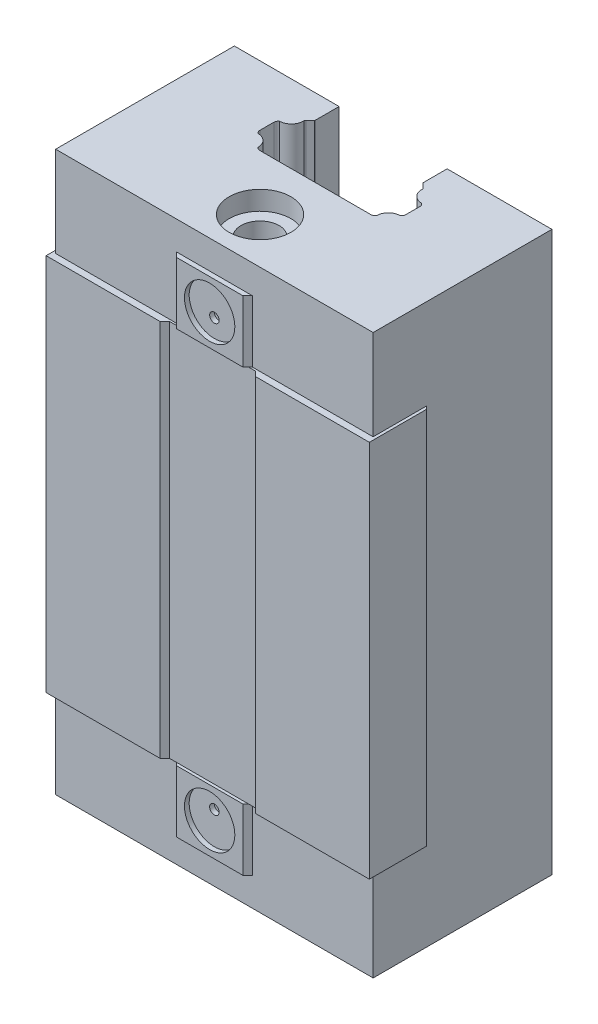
ISO-10303-21;
HEADER;
FILE_DESCRIPTION(('STEP AP214'),'2;1');
FILE_NAME('part.step','',(''),(''),'','','');
FILE_SCHEMA(('AUTOMOTIVE_DESIGN { 1 0 10303 214 1 1 1 1 }'));
ENDSEC;
DATA;
#1=APPLICATION_CONTEXT('core data for automotive mechanical design processes');
#2=APPLICATION_PROTOCOL_DEFINITION('international standard','automotive_design',2000,#1);
#3=PRODUCT_CONTEXT('',#1,'mechanical');
#4=PRODUCT('Part','Part','',(#3));
#5=PRODUCT_RELATED_PRODUCT_CATEGORY('part','',(#4));
#6=PRODUCT_DEFINITION_FORMATION('','',#4);
#7=PRODUCT_DEFINITION_CONTEXT('part definition',#1,'design');
#8=PRODUCT_DEFINITION('design','',#6,#7);
#9=PRODUCT_DEFINITION_SHAPE('','',#8);
#10=(LENGTH_UNIT() NAMED_UNIT(*) SI_UNIT(.MILLI.,.METRE.));
#11=(NAMED_UNIT(*) PLANE_ANGLE_UNIT() SI_UNIT($,.RADIAN.));
#12=(NAMED_UNIT(*) SI_UNIT($,.STERADIAN.) SOLID_ANGLE_UNIT());
#13=UNCERTAINTY_MEASURE_WITH_UNIT(LENGTH_MEASURE(1.E-05),#10,'distance_accuracy_value','');
#14=(GEOMETRIC_REPRESENTATION_CONTEXT(3) GLOBAL_UNCERTAINTY_ASSIGNED_CONTEXT((#13)) GLOBAL_UNIT_ASSIGNED_CONTEXT((#10,
#11,#12)) REPRESENTATION_CONTEXT('',''));
#15=CARTESIAN_POINT('',(0.,0.,0.));
#16=DIRECTION('',(0.,0.,1.));
#17=DIRECTION('',(1.,0.,0.));
#18=AXIS2_PLACEMENT_3D('',#15,#16,#17);
#19=CARTESIAN_POINT('',(0.,0.,2.5));
#20=DIRECTION('',(0.,0.,-1.));
#21=DIRECTION('',(-1.,0.,0.));
#22=AXIS2_PLACEMENT_3D('',#19,#20,#21);
#23=PLANE('',#22);
#24=DIRECTION('',(0.,-1.,0.));
#25=VECTOR('',#24,1.);
#26=CARTESIAN_POINT('',(39.319999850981,164.400025,2.50000000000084));
#27=LINE('',#26,#25);
#28=CARTESIAN_POINT('',(39.319999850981,165.4,2.50000000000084));
#29=VERTEX_POINT('',#28);
#30=CARTESIAN_POINT('',(39.319999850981,106.6,2.50000000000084));
#31=VERTEX_POINT('',#30);
#32=EDGE_CURVE('E266',#29,#31,#27,.T.);
#33=ORIENTED_EDGE('',*,*,#32,.T.);
#34=DIRECTION('',(1.,0.,0.));
#35=VECTOR('',#34,1.);
#36=CARTESIAN_POINT('',(28.29999985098,106.6,2.5));
#37=LINE('',#36,#35);
#38=CARTESIAN_POINT('',(28.29999985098,106.6,2.5));
#39=VERTEX_POINT('',#38);
#40=EDGE_CURVE('E612',#39,#31,#37,.T.);
#41=ORIENTED_EDGE('',*,*,#40,.F.);
#42=DIRECTION('',(0.,-1.,0.));
#43=VECTOR('',#42,1.);
#44=CARTESIAN_POINT('',(28.29999985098,164.4,2.5));
#45=LINE('',#44,#43);
#46=CARTESIAN_POINT('',(28.29999985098,165.4,2.5));
#47=VERTEX_POINT('',#46);
#48=EDGE_CURVE('E257',#47,#39,#45,.T.);
#49=ORIENTED_EDGE('',*,*,#48,.F.);
#50=DIRECTION('',(-1.,0.,0.));
#51=VECTOR('',#50,1.);
#52=CARTESIAN_POINT('',(39.319999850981,165.4,2.50000000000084));
#53=LINE('',#52,#51);
#54=EDGE_CURVE('E644',#29,#47,#53,.T.);
#55=ORIENTED_EDGE('',*,*,#54,.F.);
#56=EDGE_LOOP('',(#33,#41,#49,#55));
#57=FACE_BOUND('',#56,.T.);
#58=ADVANCED_FACE('F33',(#57),#23,.T.);
#59=CARTESIAN_POINT('',(49.49999985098,107.599975,21.5));
#60=DIRECTION('',(0.,0.,-1.));
#61=DIRECTION('',(-1.,0.,0.));
#62=AXIS2_PLACEMENT_3D('',#59,#60,#61);
#63=PLANE('',#62);
#64=DIRECTION('',(-1.,0.,0.));
#65=VECTOR('',#64,1.);
#66=CARTESIAN_POINT('',(40.99999985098,116.1,21.5));
#67=LINE('',#66,#65);
#68=CARTESIAN_POINT('',(48.79999985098,116.1,21.5));
#69=VERTEX_POINT('',#68);
#70=CARTESIAN_POINT('',(41.19999985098,116.1,21.5));
#71=VERTEX_POINT('',#70);
#72=EDGE_CURVE('E52',#69,#71,#67,.T.);
#73=ORIENTED_EDGE('',*,*,#72,.F.);
#74=DIRECTION('',(1.,0.,0.));
#75=VECTOR('',#74,1.);
#76=CARTESIAN_POINT('',(61.99999985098,116.1,21.5));
#77=LINE('',#76,#75);
#78=CARTESIAN_POINT('',(49.49999985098,116.1,21.5));
#79=VERTEX_POINT('',#78);
#80=EDGE_CURVE('E235',#69,#79,#77,.T.);
#81=ORIENTED_EDGE('',*,*,#80,.T.);
#82=DIRECTION('',(0.,1.,0.));
#83=VECTOR('',#82,1.);
#84=CARTESIAN_POINT('',(49.49999985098,107.599975,21.5));
#85=LINE('',#84,#83);
#86=CARTESIAN_POINT('',(49.49999985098,155.9,21.5));
#87=VERTEX_POINT('',#86);
#88=EDGE_CURVE('E111',#79,#87,#85,.T.);
#89=ORIENTED_EDGE('',*,*,#88,.T.);
#90=DIRECTION('',(-1.,0.,0.));
#91=VECTOR('',#90,1.);
#92=CARTESIAN_POINT('',(49.49999985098,155.9,21.5));
#93=LINE('',#92,#91);
#94=CARTESIAN_POINT('',(48.79999985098,155.9,21.5));
#95=VERTEX_POINT('',#94);
#96=EDGE_CURVE('E227',#87,#95,#93,.T.);
#97=ORIENTED_EDGE('',*,*,#96,.T.);
#98=DIRECTION('',(1.,0.,0.));
#99=VECTOR('',#98,1.);
#100=CARTESIAN_POINT('',(48.99999985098,155.9,21.5));
#101=LINE('',#100,#99);
#102=CARTESIAN_POINT('',(41.19999985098,155.9,21.5));
#103=VERTEX_POINT('',#102);
#104=EDGE_CURVE('E211',#103,#95,#101,.T.);
#105=ORIENTED_EDGE('',*,*,#104,.F.);
#106=CARTESIAN_POINT('',(40.49999985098,155.9,21.5));
#107=VERTEX_POINT('',#106);
#108=EDGE_CURVE('E229',#103,#107,#93,.T.);
#109=ORIENTED_EDGE('',*,*,#108,.T.);
#110=DIRECTION('',(0.,1.,0.));
#111=VECTOR('',#110,1.);
#112=CARTESIAN_POINT('',(40.49999985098,107.599975,21.5));
#113=LINE('',#112,#111);
#114=CARTESIAN_POINT('',(40.49999985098,116.1,21.5));
#115=VERTEX_POINT('',#114);
#116=EDGE_CURVE('E230',#115,#107,#113,.T.);
#117=ORIENTED_EDGE('',*,*,#116,.F.);
#118=EDGE_CURVE('E237',#115,#71,#77,.T.);
#119=ORIENTED_EDGE('',*,*,#118,.T.);
#120=EDGE_LOOP('',(#73,#81,#89,#97,#105,#109,#117,#119));
#121=FACE_BOUND('',#120,.T.);
#122=ADVANCED_FACE('F883',(#121),#63,.F.);
#123=CARTESIAN_POINT('',(61.99999985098,116.1,22.));
#124=DIRECTION('',(0.,-1.,0.));
#125=DIRECTION('',(0.,0.,-1.));
#126=AXIS2_PLACEMENT_3D('',#123,#124,#125);
#127=PLANE('',#126);
#128=ORIENTED_EDGE('',*,*,#80,.F.);
#129=DIRECTION('',(-0.70710678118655,0.,0.707106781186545));
#130=VECTOR('',#129,1.);
#131=CARTESIAN_POINT('',(55.14999985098,116.1,15.15));
#132=LINE('',#131,#130);
#133=CARTESIAN_POINT('',(48.99999985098,116.1,21.3));
#134=VERTEX_POINT('',#133);
#135=EDGE_CURVE('E188',#69,#134,#132,.F.);
#136=ORIENTED_EDGE('',*,*,#135,.T.);
#137=DIRECTION('',(-1.,0.,0.));
#138=VECTOR('',#137,1.);
#139=CARTESIAN_POINT('',(28.29999985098,116.1,21.3));
#140=LINE('',#139,#138);
#141=CARTESIAN_POINT('',(61.69999985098,116.1,21.3));
#142=VERTEX_POINT('',#141);
#143=EDGE_CURVE('E239',#142,#134,#140,.T.);
#144=ORIENTED_EDGE('',*,*,#143,.F.);
#145=DIRECTION('',(0.,0.,1.));
#146=VECTOR('',#145,1.);
#147=CARTESIAN_POINT('',(61.69999985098,116.1,21.3));
#148=LINE('',#147,#146);
#149=CARTESIAN_POINT('',(61.69999985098,116.1,15.7000000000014));
#150=VERTEX_POINT('',#149);
#151=EDGE_CURVE('E252',#150,#142,#148,.T.);
#152=ORIENTED_EDGE('',*,*,#151,.F.);
#153=DIRECTION('',(-0.707106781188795,0.,-0.7071067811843));
#154=VECTOR('',#153,1.);
#155=CARTESIAN_POINT('',(61.9999998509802,116.1,15.9999999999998));
#156=LINE('',#155,#154);
#157=CARTESIAN_POINT('',(61.9999998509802,116.1,15.9999999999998));
#158=VERTEX_POINT('',#157);
#159=EDGE_CURVE('E256',#150,#158,#156,.F.);
#160=ORIENTED_EDGE('',*,*,#159,.T.);
#161=DIRECTION('',(0.,0.,-1.));
#162=VECTOR('',#161,1.);
#163=CARTESIAN_POINT('',(61.99999985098,116.1,22.));
#164=LINE('',#163,#162);
#165=CARTESIAN_POINT('',(61.99999985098,116.1,22.));
#166=VERTEX_POINT('',#165);
#167=EDGE_CURVE('E820',#166,#158,#164,.T.);
#168=ORIENTED_EDGE('',*,*,#167,.F.);
#169=DIRECTION('',(-1.,0.,0.));
#170=VECTOR('',#169,1.);
#171=CARTESIAN_POINT('',(61.99999985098,116.1,22.));
#172=LINE('',#171,#170);
#173=CARTESIAN_POINT('',(49.9999998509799,116.1,22.));
#174=VERTEX_POINT('',#173);
#175=EDGE_CURVE('E813',#166,#174,#172,.T.);
#176=ORIENTED_EDGE('',*,*,#175,.T.);
#177=DIRECTION('',(-0.707106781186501,0.,-0.707106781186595));
#178=VECTOR('',#177,1.);
#179=CARTESIAN_POINT('',(55.9999998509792,116.1,28.));
#180=LINE('',#179,#178);
#181=EDGE_CURVE('E233',#79,#174,#180,.F.);
#182=ORIENTED_EDGE('',*,*,#181,.F.);
#183=EDGE_LOOP('',(#128,#136,#144,#152,#160,#168,#176,#182));
#184=FACE_BOUND('',#183,.T.);
#185=ADVANCED_FACE('F901',(#184),#127,.T.);
#186=DIRECTION('',(-1.,0.,0.));
#187=VECTOR('',#186,1.);
#188=CARTESIAN_POINT('',(28.2999998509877,116.1,16.));
#189=LINE('',#188,#187);
#190=CARTESIAN_POINT('',(28.2999998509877,116.1,16.));
#191=VERTEX_POINT('',#190);
#192=CARTESIAN_POINT('',(27.9999998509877,116.1,16.));
#193=VERTEX_POINT('',#192);
#194=EDGE_CURVE('E368',#191,#193,#189,.T.);
#195=ORIENTED_EDGE('',*,*,#194,.F.);
#196=DIRECTION('',(0.,0.,-1.));
#197=VECTOR('',#196,1.);
#198=CARTESIAN_POINT('',(28.29999985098,116.1,2.5));
#199=LINE('',#198,#197);
#200=CARTESIAN_POINT('',(28.29999985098,116.1,21.3));
#201=VERTEX_POINT('',#200);
#202=EDGE_CURVE('E242',#201,#191,#199,.T.);
#203=ORIENTED_EDGE('',*,*,#202,.F.);
#204=CARTESIAN_POINT('',(40.99999985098,116.1,21.3));
#205=VERTEX_POINT('',#204);
#206=EDGE_CURVE('E243',#205,#201,#140,.T.);
#207=ORIENTED_EDGE('',*,*,#206,.F.);
#208=DIRECTION('',(0.70710678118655,0.,0.707106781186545));
#209=VECTOR('',#208,1.);
#210=CARTESIAN_POINT('',(40.99999985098,116.1,21.3));
#211=LINE('',#210,#209);
#212=EDGE_CURVE('E270',#71,#205,#211,.F.);
#213=ORIENTED_EDGE('',*,*,#212,.F.);
#214=ORIENTED_EDGE('',*,*,#118,.F.);
#215=DIRECTION('',(-0.707106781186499,0.,0.707106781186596));
#216=VECTOR('',#215,1.);
#217=CARTESIAN_POINT('',(50.9999998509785,116.1,11.));
#218=LINE('',#217,#216);
#219=CARTESIAN_POINT('',(39.9999998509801,116.1,22.));
#220=VERTEX_POINT('',#219);
#221=EDGE_CURVE('E238',#220,#115,#218,.F.);
#222=ORIENTED_EDGE('',*,*,#221,.F.);
#223=CARTESIAN_POINT('',(27.9999998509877,116.1,22.));
#224=VERTEX_POINT('',#223);
#225=EDGE_CURVE('E812',#220,#224,#172,.T.);
#226=ORIENTED_EDGE('',*,*,#225,.T.);
#227=DIRECTION('',(0.,0.,-1.));
#228=VECTOR('',#227,1.);
#229=CARTESIAN_POINT('',(27.9999998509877,116.1,22.));
#230=LINE('',#229,#228);
#231=EDGE_CURVE('E817',#224,#193,#230,.T.);
#232=ORIENTED_EDGE('',*,*,#231,.T.);
#233=EDGE_LOOP('',(#195,#203,#207,#213,#214,#222,#226,#232));
#234=FACE_BOUND('',#233,.T.);
#235=ADVANCED_FACE('F863',(#234),#127,.T.);
#236=CARTESIAN_POINT('',(28.29999985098,107.6,21.3));
#237=DIRECTION('',(0.,0.,-1.));
#238=DIRECTION('',(-1.,0.,0.));
#239=AXIS2_PLACEMENT_3D('',#236,#237,#238);
#240=PLANE('',#239);
#241=DIRECTION('',(0.,1.,0.));
#242=VECTOR('',#241,1.);
#243=CARTESIAN_POINT('',(48.99999985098,116.1,21.3));
#244=LINE('',#243,#242);
#245=CARTESIAN_POINT('',(48.99999985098,109.6,21.3));
#246=VERTEX_POINT('',#245);
#247=EDGE_CURVE('E190',#246,#134,#244,.T.);
#248=ORIENTED_EDGE('',*,*,#247,.F.);
#249=DIRECTION('',(1.,0.,0.));
#250=VECTOR('',#249,1.);
#251=CARTESIAN_POINT('',(48.99999985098,109.6,21.3));
#252=LINE('',#251,#250);
#253=CARTESIAN_POINT('',(40.99999985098,109.6,21.3));
#254=VERTEX_POINT('',#253);
#255=EDGE_CURVE('E205',#254,#246,#252,.T.);
#256=ORIENTED_EDGE('',*,*,#255,.F.);
#257=DIRECTION('',(0.,-1.,0.));
#258=VECTOR('',#257,1.);
#259=CARTESIAN_POINT('',(40.99999985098,109.6,21.3));
#260=LINE('',#259,#258);
#261=EDGE_CURVE('E202',#205,#254,#260,.T.);
#262=ORIENTED_EDGE('',*,*,#261,.F.);
#263=ORIENTED_EDGE('',*,*,#206,.T.);
#264=DIRECTION('',(0.,1.,0.));
#265=VECTOR('',#264,1.);
#266=CARTESIAN_POINT('',(28.29999985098,107.6,21.3));
#267=LINE('',#266,#265);
#268=CARTESIAN_POINT('',(28.29999985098,106.6,21.3));
#269=VERTEX_POINT('',#268);
#270=EDGE_CURVE('E246',#269,#201,#267,.T.);
#271=ORIENTED_EDGE('',*,*,#270,.F.);
#272=DIRECTION('',(-1.,0.,0.));
#273=VECTOR('',#272,1.);
#274=CARTESIAN_POINT('',(61.69999985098,106.6,21.3));
#275=LINE('',#274,#273);
#276=CARTESIAN_POINT('',(61.69999985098,106.6,21.3));
#277=VERTEX_POINT('',#276);
#278=EDGE_CURVE('E358',#277,#269,#275,.T.);
#279=ORIENTED_EDGE('',*,*,#278,.F.);
#280=DIRECTION('',(0.,1.,0.));
#281=VECTOR('',#280,1.);
#282=CARTESIAN_POINT('',(61.69999985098,107.6,21.3));
#283=LINE('',#282,#281);
#284=EDGE_CURVE('E792',#277,#142,#283,.T.);
#285=ORIENTED_EDGE('',*,*,#284,.T.);
#286=ORIENTED_EDGE('',*,*,#143,.T.);
#287=EDGE_LOOP('',(#248,#256,#262,#263,#271,#279,#285,#286));
#288=FACE_BOUND('',#287,.T.);
#289=ADVANCED_FACE('F857',(#288),#240,.F.);
#290=CARTESIAN_POINT('',(27.9999998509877,155.9,22.));
#291=DIRECTION('',(0.,1.,0.));
#292=DIRECTION('',(0.,0.,1.));
#293=AXIS2_PLACEMENT_3D('',#290,#291,#292);
#294=PLANE('',#293);
#295=DIRECTION('',(1.,0.,0.));
#296=VECTOR('',#295,1.);
#297=CARTESIAN_POINT('',(61.69999985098,155.9,21.3));
#298=LINE('',#297,#296);
#299=CARTESIAN_POINT('',(48.99999985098,155.9,21.3));
#300=VERTEX_POINT('',#299);
#301=CARTESIAN_POINT('',(61.69999985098,155.9,21.3));
#302=VERTEX_POINT('',#301);
#303=EDGE_CURVE('E782',#300,#302,#298,.T.);
#304=ORIENTED_EDGE('',*,*,#303,.F.);
#305=DIRECTION('',(-0.70710678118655,0.,0.707106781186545));
#306=VECTOR('',#305,1.);
#307=CARTESIAN_POINT('',(48.99999985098,155.9,21.3));
#308=LINE('',#307,#306);
#309=EDGE_CURVE('E226',#95,#300,#308,.F.);
#310=ORIENTED_EDGE('',*,*,#309,.F.);
#311=ORIENTED_EDGE('',*,*,#96,.F.);
#312=DIRECTION('',(0.707106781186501,0.,0.707106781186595));
#313=VECTOR('',#312,1.);
#314=CARTESIAN_POINT('',(38.9999998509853,155.9,11.0000000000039));
#315=LINE('',#314,#313);
#316=CARTESIAN_POINT('',(49.9999998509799,155.9,22.));
#317=VERTEX_POINT('',#316);
#318=EDGE_CURVE('E304',#317,#87,#315,.F.);
#319=ORIENTED_EDGE('',*,*,#318,.F.);
#320=DIRECTION('',(1.,0.,0.));
#321=VECTOR('',#320,1.);
#322=CARTESIAN_POINT('',(27.9999998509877,155.9,22.));
#323=LINE('',#322,#321);
#324=CARTESIAN_POINT('',(61.99999985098,155.9,22.));
#325=VERTEX_POINT('',#324);
#326=EDGE_CURVE('E805',#317,#325,#323,.T.);
#327=ORIENTED_EDGE('',*,*,#326,.T.);
#328=DIRECTION('',(0.,0.,-1.));
#329=VECTOR('',#328,1.);
#330=CARTESIAN_POINT('',(61.99999985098,155.9,22.));
#331=LINE('',#330,#329);
#332=CARTESIAN_POINT('',(61.9999998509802,155.9,15.9999999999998));
#333=VERTEX_POINT('',#332);
#334=EDGE_CURVE('E823',#325,#333,#331,.T.);
#335=ORIENTED_EDGE('',*,*,#334,.T.);
#336=DIRECTION('',(-0.707106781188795,0.,-0.7071067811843));
#337=VECTOR('',#336,1.);
#338=CARTESIAN_POINT('',(47.999999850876,155.9,1.99999999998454));
#339=LINE('',#338,#337);
#340=CARTESIAN_POINT('',(61.69999985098,155.9,15.7000000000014));
#341=VERTEX_POINT('',#340);
#342=EDGE_CURVE('E254',#341,#333,#339,.F.);
#343=ORIENTED_EDGE('',*,*,#342,.F.);
#344=DIRECTION('',(0.,0.,-1.));
#345=VECTOR('',#344,1.);
#346=CARTESIAN_POINT('',(61.69999985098,155.9,2.5));
#347=LINE('',#346,#345);
#348=EDGE_CURVE('E787',#302,#341,#347,.T.);
#349=ORIENTED_EDGE('',*,*,#348,.F.);
#350=EDGE_LOOP('',(#304,#310,#311,#319,#327,#335,#343,#349));
#351=FACE_BOUND('',#350,.T.);
#352=ADVANCED_FACE('F784',(#351),#294,.T.);
#353=DIRECTION('',(-1.,0.,0.));
#354=VECTOR('',#353,1.);
#355=CARTESIAN_POINT('',(28.2999998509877,155.9,16.));
#356=LINE('',#355,#354);
#357=CARTESIAN_POINT('',(28.2999998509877,155.9,16.));
#358=VERTEX_POINT('',#357);
#359=CARTESIAN_POINT('',(27.9999998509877,155.9,16.));
#360=VERTEX_POINT('',#359);
#361=EDGE_CURVE('E371',#358,#360,#356,.T.);
#362=ORIENTED_EDGE('',*,*,#361,.T.);
#363=DIRECTION('',(0.,0.,-1.));
#364=VECTOR('',#363,1.);
#365=CARTESIAN_POINT('',(27.9999998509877,155.9,22.));
#366=LINE('',#365,#364);
#367=CARTESIAN_POINT('',(27.9999998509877,155.9,22.));
#368=VERTEX_POINT('',#367);
#369=EDGE_CURVE('E816',#368,#360,#366,.T.);
#370=ORIENTED_EDGE('',*,*,#369,.F.);
#371=CARTESIAN_POINT('',(39.9999998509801,155.9,22.));
#372=VERTEX_POINT('',#371);
#373=EDGE_CURVE('E806',#368,#372,#323,.T.);
#374=ORIENTED_EDGE('',*,*,#373,.T.);
#375=DIRECTION('',(0.707106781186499,0.,-0.707106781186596));
#376=VECTOR('',#375,1.);
#377=CARTESIAN_POINT('',(33.9999998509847,155.9,27.9999999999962));
#378=LINE('',#377,#376);
#379=EDGE_CURVE('E289',#107,#372,#378,.F.);
#380=ORIENTED_EDGE('',*,*,#379,.F.);
#381=ORIENTED_EDGE('',*,*,#108,.F.);
#382=DIRECTION('',(0.70710678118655,0.,0.707106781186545));
#383=VECTOR('',#382,1.);
#384=CARTESIAN_POINT('',(34.8499998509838,155.9,15.1500000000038));
#385=LINE('',#384,#383);
#386=CARTESIAN_POINT('',(40.99999985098,155.9,21.3));
#387=VERTEX_POINT('',#386);
#388=EDGE_CURVE('E280',#103,#387,#385,.F.);
#389=ORIENTED_EDGE('',*,*,#388,.T.);
#390=CARTESIAN_POINT('',(28.29999985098,155.9,21.3));
#391=VERTEX_POINT('',#390);
#392=EDGE_CURVE('E789',#391,#387,#298,.T.);
#393=ORIENTED_EDGE('',*,*,#392,.F.);
#394=DIRECTION('',(0.,0.,1.));
#395=VECTOR('',#394,1.);
#396=CARTESIAN_POINT('',(28.29999985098,155.9,21.3));
#397=LINE('',#396,#395);
#398=EDGE_CURVE('E37',#358,#391,#397,.T.);
#399=ORIENTED_EDGE('',*,*,#398,.F.);
#400=EDGE_LOOP('',(#362,#370,#374,#380,#381,#389,#393,#399));
#401=FACE_BOUND('',#400,.T.);
#402=ADVANCED_FACE('F873',(#401),#294,.T.);
#403=CARTESIAN_POINT('',(61.69999985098,164.4,21.3));
#404=DIRECTION('',(0.,0.,-1.));
#405=DIRECTION('',(-1.,0.,0.));
#406=AXIS2_PLACEMENT_3D('',#403,#404,#405);
#407=PLANE('',#406);
#408=DIRECTION('',(0.,1.,0.));
#409=VECTOR('',#408,1.);
#410=CARTESIAN_POINT('',(48.99999985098,162.4,21.3));
#411=LINE('',#410,#409);
#412=CARTESIAN_POINT('',(48.99999985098,162.4,21.3));
#413=VERTEX_POINT('',#412);
#414=EDGE_CURVE('E216',#300,#413,#411,.T.);
#415=ORIENTED_EDGE('',*,*,#414,.F.);
#416=ORIENTED_EDGE('',*,*,#303,.T.);
#417=DIRECTION('',(0.,-1.,0.));
#418=VECTOR('',#417,1.);
#419=CARTESIAN_POINT('',(61.69999985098,164.4,21.3));
#420=LINE('',#419,#418);
#421=CARTESIAN_POINT('',(61.69999985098,165.4,21.3));
#422=VERTEX_POINT('',#421);
#423=EDGE_CURVE('E794',#422,#302,#420,.T.);
#424=ORIENTED_EDGE('',*,*,#423,.F.);
#425=DIRECTION('',(1.,0.,0.));
#426=VECTOR('',#425,1.);
#427=CARTESIAN_POINT('',(28.29999985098,165.4,21.3));
#428=LINE('',#427,#426);
#429=CARTESIAN_POINT('',(28.29999985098,165.4,21.3));
#430=VERTEX_POINT('',#429);
#431=EDGE_CURVE('E650',#430,#422,#428,.T.);
#432=ORIENTED_EDGE('',*,*,#431,.F.);
#433=DIRECTION('',(0.,-1.,0.));
#434=VECTOR('',#433,1.);
#435=CARTESIAN_POINT('',(28.29999985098,164.4,21.3));
#436=LINE('',#435,#434);
#437=EDGE_CURVE('E796',#430,#391,#436,.T.);
#438=ORIENTED_EDGE('',*,*,#437,.T.);
#439=ORIENTED_EDGE('',*,*,#392,.T.);
#440=DIRECTION('',(0.,-1.,0.));
#441=VECTOR('',#440,1.);
#442=CARTESIAN_POINT('',(40.99999985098,155.9,21.3));
#443=LINE('',#442,#441);
#444=CARTESIAN_POINT('',(40.99999985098,162.4,21.3));
#445=VERTEX_POINT('',#444);
#446=EDGE_CURVE('E223',#445,#387,#443,.T.);
#447=ORIENTED_EDGE('',*,*,#446,.F.);
#448=DIRECTION('',(-1.,0.,0.));
#449=VECTOR('',#448,1.);
#450=CARTESIAN_POINT('',(40.99999985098,162.4,21.3));
#451=LINE('',#450,#449);
#452=EDGE_CURVE('E219',#413,#445,#451,.T.);
#453=ORIENTED_EDGE('',*,*,#452,.F.);
#454=EDGE_LOOP('',(#415,#416,#424,#432,#438,#439,#447,#453));
#455=FACE_BOUND('',#454,.T.);
#456=ADVANCED_FACE('F780',(#455),#407,.F.);
#457=CARTESIAN_POINT('',(0.,0.,22.));
#458=DIRECTION('',(0.,0.,-1.));
#459=DIRECTION('',(-1.,0.,0.));
#460=AXIS2_PLACEMENT_3D('',#457,#458,#459);
#461=PLANE('',#460);
#462=ORIENTED_EDGE('',*,*,#225,.F.);
#463=DIRECTION('',(0.,-1.,0.));
#464=VECTOR('',#463,1.);
#465=CARTESIAN_POINT('',(39.9999998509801,0.,22.));
#466=LINE('',#465,#464);
#467=EDGE_CURVE('E299',#220,#372,#466,.F.);
#468=ORIENTED_EDGE('',*,*,#467,.T.);
#469=ORIENTED_EDGE('',*,*,#373,.F.);
#470=DIRECTION('',(0.,1.,0.));
#471=VECTOR('',#470,1.);
#472=CARTESIAN_POINT('',(27.9999998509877,116.1,22.));
#473=LINE('',#472,#471);
#474=EDGE_CURVE('E801',#224,#368,#473,.T.);
#475=ORIENTED_EDGE('',*,*,#474,.F.);
#476=EDGE_LOOP('',(#462,#468,#469,#475));
#477=FACE_BOUND('',#476,.T.);
#478=ADVANCED_FACE('F877',(#477),#461,.F.);
#479=CARTESIAN_POINT('',(27.9999998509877,116.1,22.));
#480=DIRECTION('',(-1.,0.,0.));
#481=DIRECTION('',(0.,0.,1.));
#482=AXIS2_PLACEMENT_3D('',#479,#480,#481);
#483=PLANE('',#482);
#484=DIRECTION('',(0.,1.,0.));
#485=VECTOR('',#484,1.);
#486=CARTESIAN_POINT('',(27.9999998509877,155.9,16.));
#487=LINE('',#486,#485);
#488=EDGE_CURVE('E364',#193,#360,#487,.T.);
#489=ORIENTED_EDGE('',*,*,#488,.F.);
#490=ORIENTED_EDGE('',*,*,#231,.F.);
#491=ORIENTED_EDGE('',*,*,#474,.T.);
#492=ORIENTED_EDGE('',*,*,#369,.T.);
#493=EDGE_LOOP('',(#489,#490,#491,#492));
#494=FACE_BOUND('',#493,.T.);
#495=ADVANCED_FACE('F869',(#494),#483,.T.);
#496=CARTESIAN_POINT('',(61.99999985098,155.9,22.));
#497=DIRECTION('',(1.,0.,0.));
#498=DIRECTION('',(0.,0.,-1.));
#499=AXIS2_PLACEMENT_3D('',#496,#497,#498);
#500=PLANE('',#499);
#501=DIRECTION('',(0.,1.,0.));
#502=VECTOR('',#501,1.);
#503=CARTESIAN_POINT('',(61.9999998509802,116.1,15.9999999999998));
#504=LINE('',#503,#502);
#505=EDGE_CURVE('E260',#158,#333,#504,.T.);
#506=ORIENTED_EDGE('',*,*,#505,.T.);
#507=ORIENTED_EDGE('',*,*,#334,.F.);
#508=DIRECTION('',(0.,-1.,0.));
#509=VECTOR('',#508,1.);
#510=CARTESIAN_POINT('',(61.99999985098,155.9,22.));
#511=LINE('',#510,#509);
#512=EDGE_CURVE('E809',#325,#166,#511,.T.);
#513=ORIENTED_EDGE('',*,*,#512,.T.);
#514=ORIENTED_EDGE('',*,*,#167,.T.);
#515=EDGE_LOOP('',(#506,#507,#513,#514));
#516=FACE_BOUND('',#515,.T.);
#517=ADVANCED_FACE('F914',(#516),#500,.T.);
#518=ORIENTED_EDGE('',*,*,#326,.F.);
#519=DIRECTION('',(0.,1.,0.));
#520=VECTOR('',#519,1.);
#521=CARTESIAN_POINT('',(49.99999985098,0.,22.));
#522=LINE('',#521,#520);
#523=EDGE_CURVE('E104',#317,#174,#522,.F.);
#524=ORIENTED_EDGE('',*,*,#523,.T.);
#525=ORIENTED_EDGE('',*,*,#175,.F.);
#526=ORIENTED_EDGE('',*,*,#512,.F.);
#527=EDGE_LOOP('',(#518,#524,#525,#526));
#528=FACE_BOUND('',#527,.T.);
#529=ADVANCED_FACE('F907',(#528),#461,.F.);
#530=DIRECTION('',(0.,-1.,0.));
#531=VECTOR('',#530,1.);
#532=CARTESIAN_POINT('',(50.6799998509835,164.400025,2.50000000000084));
#533=LINE('',#532,#531);
#534=CARTESIAN_POINT('',(50.6799998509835,165.4,2.50000000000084));
#535=VERTEX_POINT('',#534);
#536=CARTESIAN_POINT('',(50.6799998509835,106.6,2.5));
#537=VERTEX_POINT('',#536);
#538=EDGE_CURVE('E418',#535,#537,#533,.T.);
#539=ORIENTED_EDGE('',*,*,#538,.F.);
#540=DIRECTION('',(-1.,0.,0.));
#541=VECTOR('',#540,1.);
#542=CARTESIAN_POINT('',(61.69999985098,165.4,2.5));
#543=LINE('',#542,#541);
#544=CARTESIAN_POINT('',(61.69999985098,165.4,2.5));
#545=VERTEX_POINT('',#544);
#546=EDGE_CURVE('E656',#545,#535,#543,.T.);
#547=ORIENTED_EDGE('',*,*,#546,.F.);
#548=DIRECTION('',(0.,1.,0.));
#549=VECTOR('',#548,1.);
#550=CARTESIAN_POINT('',(61.69999985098,116.1,2.5));
#551=LINE('',#550,#549);
#552=CARTESIAN_POINT('',(61.69999985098,106.6,2.5));
#553=VERTEX_POINT('',#552);
#554=EDGE_CURVE('E261',#553,#545,#551,.T.);
#555=ORIENTED_EDGE('',*,*,#554,.F.);
#556=DIRECTION('',(1.,0.,0.));
#557=VECTOR('',#556,1.);
#558=CARTESIAN_POINT('',(50.6799998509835,106.6,2.5));
#559=LINE('',#558,#557);
#560=EDGE_CURVE('E349',#537,#553,#559,.T.);
#561=ORIENTED_EDGE('',*,*,#560,.F.);
#562=EDGE_LOOP('',(#539,#547,#555,#561));
#563=FACE_BOUND('',#562,.T.);
#564=ADVANCED_FACE('F854',(#563),#23,.T.);
#565=CARTESIAN_POINT('',(61.9999998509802,116.1,15.9999999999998));
#566=DIRECTION('',(0.7071067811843,0.,-0.707106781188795));
#567=DIRECTION('',(-0.707106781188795,0.,-0.7071067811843));
#568=AXIS2_PLACEMENT_3D('',#565,#566,#567);
#569=PLANE('',#568);
#570=ORIENTED_EDGE('',*,*,#342,.T.);
#571=ORIENTED_EDGE('',*,*,#505,.F.);
#572=ORIENTED_EDGE('',*,*,#159,.F.);
#573=DIRECTION('',(0.,-1.,0.));
#574=VECTOR('',#573,1.);
#575=CARTESIAN_POINT('',(61.69999985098,116.1,15.7000000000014));
#576=LINE('',#575,#574);
#577=EDGE_CURVE('E258',#150,#341,#576,.F.);
#578=ORIENTED_EDGE('',*,*,#577,.T.);
#579=EDGE_LOOP('',(#570,#571,#572,#578));
#580=FACE_BOUND('',#579,.T.);
#581=ADVANCED_FACE('F906',(#580),#569,.T.);
#582=CARTESIAN_POINT('',(61.69999985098,116.1,2.5));
#583=DIRECTION('',(-1.,0.,0.));
#584=DIRECTION('',(0.,0.,1.));
#585=AXIS2_PLACEMENT_3D('',#582,#583,#584);
#586=PLANE('',#585);
#587=ORIENTED_EDGE('',*,*,#554,.T.);
#588=DIRECTION('',(0.,0.,-1.));
#589=VECTOR('',#588,1.);
#590=CARTESIAN_POINT('',(61.69999985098,165.4,21.3));
#591=LINE('',#590,#589);
#592=EDGE_CURVE('E653',#422,#545,#591,.T.);
#593=ORIENTED_EDGE('',*,*,#592,.F.);
#594=ORIENTED_EDGE('',*,*,#423,.T.);
#595=ORIENTED_EDGE('',*,*,#348,.T.);
#596=ORIENTED_EDGE('',*,*,#577,.F.);
#597=ORIENTED_EDGE('',*,*,#151,.T.);
#598=ORIENTED_EDGE('',*,*,#284,.F.);
#599=DIRECTION('',(0.,0.,1.));
#600=VECTOR('',#599,1.);
#601=CARTESIAN_POINT('',(61.69999985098,106.6,2.5));
#602=LINE('',#601,#600);
#603=EDGE_CURVE('E355',#553,#277,#602,.T.);
#604=ORIENTED_EDGE('',*,*,#603,.F.);
#605=EDGE_LOOP('',(#587,#593,#594,#595,#596,#597,#598,#604));
#606=FACE_BOUND('',#605,.T.);
#607=ADVANCED_FACE('F852',(#606),#586,.F.);
#608=CARTESIAN_POINT('',(28.29999985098,164.4,21.3));
#609=DIRECTION('',(1.,0.,0.));
#610=DIRECTION('',(0.,0.,-1.));
#611=AXIS2_PLACEMENT_3D('',#608,#609,#610);
#612=PLANE('',#611);
#613=ORIENTED_EDGE('',*,*,#48,.T.);
#614=DIRECTION('',(0.,0.,-1.));
#615=VECTOR('',#614,1.);
#616=CARTESIAN_POINT('',(28.29999985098,106.6,21.3));
#617=LINE('',#616,#615);
#618=EDGE_CURVE('E361',#269,#39,#617,.T.);
#619=ORIENTED_EDGE('',*,*,#618,.F.);
#620=ORIENTED_EDGE('',*,*,#270,.T.);
#621=ORIENTED_EDGE('',*,*,#202,.T.);
#622=DIRECTION('',(0.,1.,0.));
#623=VECTOR('',#622,1.);
#624=CARTESIAN_POINT('',(28.2999998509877,155.9,16.));
#625=LINE('',#624,#623);
#626=EDGE_CURVE('E365',#191,#358,#625,.T.);
#627=ORIENTED_EDGE('',*,*,#626,.T.);
#628=ORIENTED_EDGE('',*,*,#398,.T.);
#629=ORIENTED_EDGE('',*,*,#437,.F.);
#630=DIRECTION('',(0.,0.,1.));
#631=VECTOR('',#630,1.);
#632=CARTESIAN_POINT('',(28.29999985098,165.4,2.5));
#633=LINE('',#632,#631);
#634=EDGE_CURVE('E647',#47,#430,#633,.T.);
#635=ORIENTED_EDGE('',*,*,#634,.F.);
#636=EDGE_LOOP('',(#613,#619,#620,#621,#627,#628,#629,#635));
#637=FACE_BOUND('',#636,.T.);
#638=ADVANCED_FACE('F835',(#637),#612,.F.);
#639=CARTESIAN_POINT('',(40.49999985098,107.599975,21.5));
#640=DIRECTION('',(0.707106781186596,0.,0.707106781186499));
#641=DIRECTION('',(0.707106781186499,0.,-0.707106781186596));
#642=AXIS2_PLACEMENT_3D('',#639,#640,#641);
#643=PLANE('',#642);
#644=ORIENTED_EDGE('',*,*,#221,.T.);
#645=ORIENTED_EDGE('',*,*,#116,.T.);
#646=ORIENTED_EDGE('',*,*,#379,.T.);
#647=ORIENTED_EDGE('',*,*,#467,.F.);
#648=EDGE_LOOP('',(#644,#645,#646,#647));
#649=FACE_BOUND('',#648,.T.);
#650=ADVANCED_FACE('F880',(#649),#643,.T.);
#651=CARTESIAN_POINT('',(49.49999985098,107.599975,21.5));
#652=DIRECTION('',(-0.707106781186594,0.,0.7071067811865));
#653=DIRECTION('',(0.707106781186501,0.,0.707106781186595));
#654=AXIS2_PLACEMENT_3D('',#651,#652,#653);
#655=PLANE('',#654);
#656=ORIENTED_EDGE('',*,*,#181,.T.);
#657=ORIENTED_EDGE('',*,*,#523,.F.);
#658=ORIENTED_EDGE('',*,*,#318,.T.);
#659=ORIENTED_EDGE('',*,*,#88,.F.);
#660=EDGE_LOOP('',(#656,#657,#658,#659));
#661=FACE_BOUND('',#660,.T.);
#662=ADVANCED_FACE('F953',(#661),#655,.T.);
#663=CARTESIAN_POINT('',(48.99999985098,162.4,21.3));
#664=DIRECTION('',(0.707106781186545,0.,0.70710678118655));
#665=DIRECTION('',(0.70710678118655,0.,-0.707106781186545));
#666=AXIS2_PLACEMENT_3D('',#663,#664,#665);
#667=PLANE('',#666);
#668=ORIENTED_EDGE('',*,*,#414,.T.);
#669=DIRECTION('',(-0.70710678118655,0.,0.707106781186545));
#670=VECTOR('',#669,1.);
#671=CARTESIAN_POINT('',(44.89999985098,162.4,25.4));
#672=LINE('',#671,#670);
#673=CARTESIAN_POINT('',(48.4999998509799,162.4,21.8));
#674=VERTEX_POINT('',#673);
#675=EDGE_CURVE('E286',#674,#413,#672,.F.);
#676=ORIENTED_EDGE('',*,*,#675,.F.);
#677=DIRECTION('',(0.,-1.,0.));
#678=VECTOR('',#677,1.);
#679=CARTESIAN_POINT('',(48.4999998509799,0.,21.8));
#680=LINE('',#679,#678);
#681=CARTESIAN_POINT('',(48.4999998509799,155.9,21.8));
#682=VERTEX_POINT('',#681);
#683=EDGE_CURVE('E210',#682,#674,#680,.F.);
#684=ORIENTED_EDGE('',*,*,#683,.F.);
#685=DIRECTION('',(-0.70710678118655,0.,0.707106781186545));
#686=VECTOR('',#685,1.);
#687=CARTESIAN_POINT('',(48.99999985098,155.9,21.3));
#688=LINE('',#687,#686);
#689=EDGE_CURVE('E220',#682,#95,#688,.F.);
#690=ORIENTED_EDGE('',*,*,#689,.T.);
#691=ORIENTED_EDGE('',*,*,#309,.T.);
#692=EDGE_LOOP('',(#668,#676,#684,#690,#691));
#693=FACE_BOUND('',#692,.T.);
#694=ADVANCED_FACE('F773',(#693),#667,.T.);
#695=CARTESIAN_POINT('',(40.99999985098,162.4,21.5));
#696=DIRECTION('',(0.,-1.,0.));
#697=DIRECTION('',(0.,0.,-1.));
#698=AXIS2_PLACEMENT_3D('',#695,#696,#697);
#699=PLANE('',#698);
#700=ORIENTED_EDGE('',*,*,#452,.T.);
#701=DIRECTION('',(0.70710678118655,0.,0.707106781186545));
#702=VECTOR('',#701,1.);
#703=CARTESIAN_POINT('',(40.99999985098,162.4,21.3));
#704=LINE('',#703,#702);
#705=CARTESIAN_POINT('',(41.49999985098,162.4,21.8));
#706=VERTEX_POINT('',#705);
#707=EDGE_CURVE('E290',#706,#445,#704,.F.);
#708=ORIENTED_EDGE('',*,*,#707,.F.);
#709=DIRECTION('',(-1.,0.,0.));
#710=VECTOR('',#709,1.);
#711=CARTESIAN_POINT('',(40.99999985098,162.4,21.8));
#712=LINE('',#711,#710);
#713=EDGE_CURVE('E212',#674,#706,#712,.T.);
#714=ORIENTED_EDGE('',*,*,#713,.F.);
#715=ORIENTED_EDGE('',*,*,#675,.T.);
#716=EDGE_LOOP('',(#700,#708,#714,#715));
#717=FACE_BOUND('',#716,.T.);
#718=ADVANCED_FACE('F967',(#717),#699,.F.);
#719=CARTESIAN_POINT('',(40.99999985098,155.9,21.3));
#720=DIRECTION('',(-0.707106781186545,0.,0.70710678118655));
#721=DIRECTION('',(0.70710678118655,0.,0.707106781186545));
#722=AXIS2_PLACEMENT_3D('',#719,#720,#721);
#723=PLANE('',#722);
#724=ORIENTED_EDGE('',*,*,#446,.T.);
#725=ORIENTED_EDGE('',*,*,#388,.F.);
#726=DIRECTION('',(0.70710678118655,0.,0.707106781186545));
#727=VECTOR('',#726,1.);
#728=CARTESIAN_POINT('',(45.24999985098,155.9,25.55));
#729=LINE('',#728,#727);
#730=CARTESIAN_POINT('',(41.49999985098,155.9,21.8));
#731=VERTEX_POINT('',#730);
#732=EDGE_CURVE('E283',#731,#103,#729,.F.);
#733=ORIENTED_EDGE('',*,*,#732,.F.);
#734=DIRECTION('',(0.,1.,0.));
#735=VECTOR('',#734,1.);
#736=CARTESIAN_POINT('',(41.49999985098,0.,21.8));
#737=LINE('',#736,#735);
#738=EDGE_CURVE('E215',#706,#731,#737,.F.);
#739=ORIENTED_EDGE('',*,*,#738,.F.);
#740=ORIENTED_EDGE('',*,*,#707,.T.);
#741=EDGE_LOOP('',(#724,#725,#733,#739,#740));
#742=FACE_BOUND('',#741,.T.);
#743=ADVANCED_FACE('F975',(#742),#723,.T.);
#744=CARTESIAN_POINT('',(48.99999985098,155.9,21.8));
#745=DIRECTION('',(0.,1.,0.));
#746=DIRECTION('',(0.,0.,1.));
#747=AXIS2_PLACEMENT_3D('',#744,#745,#746);
#748=PLANE('',#747);
#749=ORIENTED_EDGE('',*,*,#104,.T.);
#750=ORIENTED_EDGE('',*,*,#689,.F.);
#751=DIRECTION('',(1.,0.,0.));
#752=VECTOR('',#751,1.);
#753=CARTESIAN_POINT('',(48.99999985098,155.9,21.8));
#754=LINE('',#753,#752);
#755=EDGE_CURVE('E207',#731,#682,#754,.T.);
#756=ORIENTED_EDGE('',*,*,#755,.F.);
#757=ORIENTED_EDGE('',*,*,#732,.T.);
#758=EDGE_LOOP('',(#749,#750,#756,#757));
#759=FACE_BOUND('',#758,.T.);
#760=ADVANCED_FACE('F983',(#759),#748,.F.);
#761=CARTESIAN_POINT('',(0.,0.,21.8));
#762=DIRECTION('',(0.,0.,-1.));
#763=DIRECTION('',(-1.,0.,0.));
#764=AXIS2_PLACEMENT_3D('',#761,#762,#763);
#765=PLANE('',#764);
#766=CARTESIAN_POINT('',(44.99999985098,159.15,21.8));
#767=DIRECTION('',(0.,0.,1.));
#768=DIRECTION('',(1.,0.,0.));
#769=AXIS2_PLACEMENT_3D('',#766,#767,#768);
#770=CIRCLE('',#769,2.64999999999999);
#771=CARTESIAN_POINT('',(47.64999985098,159.15,21.8));
#772=VERTEX_POINT('',#771);
#773=EDGE_CURVE('E388',#772,#772,#770,.T.);
#774=ORIENTED_EDGE('',*,*,#773,.F.);
#775=EDGE_LOOP('',(#774));
#776=FACE_BOUND('',#775,.T.);
#777=ORIENTED_EDGE('',*,*,#755,.T.);
#778=ORIENTED_EDGE('',*,*,#683,.T.);
#779=ORIENTED_EDGE('',*,*,#713,.T.);
#780=ORIENTED_EDGE('',*,*,#738,.T.);
#781=EDGE_LOOP('',(#777,#778,#779,#780));
#782=FACE_BOUND('',#781,.T.);
#783=ADVANCED_FACE('F990',(#776,#782),#765,.F.);
#784=CARTESIAN_POINT('',(48.99999985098,116.1,21.3));
#785=DIRECTION('',(0.707106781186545,0.,0.70710678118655));
#786=DIRECTION('',(0.70710678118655,0.,-0.707106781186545));
#787=AXIS2_PLACEMENT_3D('',#784,#785,#786);
#788=PLANE('',#787);
#789=ORIENTED_EDGE('',*,*,#247,.T.);
#790=ORIENTED_EDGE('',*,*,#135,.F.);
#791=DIRECTION('',(-0.70710678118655,0.,0.707106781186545));
#792=VECTOR('',#791,1.);
#793=CARTESIAN_POINT('',(44.7499998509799,116.1,25.55));
#794=LINE('',#793,#792);
#795=CARTESIAN_POINT('',(48.4999998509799,116.1,21.8));
#796=VERTEX_POINT('',#795);
#797=EDGE_CURVE('E185',#796,#69,#794,.F.);
#798=ORIENTED_EDGE('',*,*,#797,.F.);
#799=DIRECTION('',(0.,-1.,0.));
#800=VECTOR('',#799,1.);
#801=CARTESIAN_POINT('',(48.4999998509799,0.,21.8));
#802=LINE('',#801,#800);
#803=CARTESIAN_POINT('',(48.4999998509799,109.6,21.8));
#804=VERTEX_POINT('',#803);
#805=EDGE_CURVE('E173',#804,#796,#802,.F.);
#806=ORIENTED_EDGE('',*,*,#805,.F.);
#807=DIRECTION('',(-0.70710678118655,0.,0.707106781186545));
#808=VECTOR('',#807,1.);
#809=CARTESIAN_POINT('',(48.99999985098,109.6,21.3));
#810=LINE('',#809,#808);
#811=EDGE_CURVE('E168',#804,#246,#810,.F.);
#812=ORIENTED_EDGE('',*,*,#811,.T.);
#813=EDGE_LOOP('',(#789,#790,#798,#806,#812));
#814=FACE_BOUND('',#813,.T.);
#815=ADVANCED_FACE('F187',(#814),#788,.T.);
#816=CARTESIAN_POINT('',(40.99999985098,109.6,21.3));
#817=DIRECTION('',(-0.707106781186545,0.,0.70710678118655));
#818=DIRECTION('',(0.70710678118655,0.,0.707106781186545));
#819=AXIS2_PLACEMENT_3D('',#816,#817,#818);
#820=PLANE('',#819);
#821=ORIENTED_EDGE('',*,*,#261,.T.);
#822=DIRECTION('',(0.70710678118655,0.,0.707106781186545));
#823=VECTOR('',#822,1.);
#824=CARTESIAN_POINT('',(45.09999985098,109.6,25.4));
#825=LINE('',#824,#823);
#826=CARTESIAN_POINT('',(41.49999985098,109.6,21.8));
#827=VERTEX_POINT('',#826);
#828=EDGE_CURVE('E267',#827,#254,#825,.F.);
#829=ORIENTED_EDGE('',*,*,#828,.F.);
#830=DIRECTION('',(0.,1.,0.));
#831=VECTOR('',#830,1.);
#832=CARTESIAN_POINT('',(41.49999985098,0.,21.8));
#833=LINE('',#832,#831);
#834=CARTESIAN_POINT('',(41.49999985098,116.1,21.8));
#835=VERTEX_POINT('',#834);
#836=EDGE_CURVE('E265',#835,#827,#833,.F.);
#837=ORIENTED_EDGE('',*,*,#836,.F.);
#838=DIRECTION('',(0.70710678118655,0.,0.707106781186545));
#839=VECTOR('',#838,1.);
#840=CARTESIAN_POINT('',(40.99999985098,116.1,21.3));
#841=LINE('',#840,#839);
#842=EDGE_CURVE('E191',#835,#71,#841,.F.);
#843=ORIENTED_EDGE('',*,*,#842,.T.);
#844=ORIENTED_EDGE('',*,*,#212,.T.);
#845=EDGE_LOOP('',(#821,#829,#837,#843,#844));
#846=FACE_BOUND('',#845,.T.);
#847=ADVANCED_FACE('F885',(#846),#820,.T.);
#848=CARTESIAN_POINT('',(48.99999985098,109.6,21.5));
#849=DIRECTION('',(0.,1.,0.));
#850=DIRECTION('',(0.,0.,1.));
#851=AXIS2_PLACEMENT_3D('',#848,#849,#850);
#852=PLANE('',#851);
#853=ORIENTED_EDGE('',*,*,#255,.T.);
#854=ORIENTED_EDGE('',*,*,#811,.F.);
#855=DIRECTION('',(1.,0.,0.));
#856=VECTOR('',#855,1.);
#857=CARTESIAN_POINT('',(48.99999985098,109.6,21.8));
#858=LINE('',#857,#856);
#859=EDGE_CURVE('E180',#827,#804,#858,.T.);
#860=ORIENTED_EDGE('',*,*,#859,.F.);
#861=ORIENTED_EDGE('',*,*,#828,.T.);
#862=EDGE_LOOP('',(#853,#854,#860,#861));
#863=FACE_BOUND('',#862,.T.);
#864=ADVANCED_FACE('F886',(#863),#852,.F.);
#865=CARTESIAN_POINT('',(40.99999985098,116.1,21.8));
#866=DIRECTION('',(0.,-1.,0.));
#867=DIRECTION('',(0.,0.,-1.));
#868=AXIS2_PLACEMENT_3D('',#865,#866,#867);
#869=PLANE('',#868);
#870=ORIENTED_EDGE('',*,*,#72,.T.);
#871=ORIENTED_EDGE('',*,*,#842,.F.);
#872=DIRECTION('',(-1.,0.,0.));
#873=VECTOR('',#872,1.);
#874=CARTESIAN_POINT('',(40.99999985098,116.1,21.8));
#875=LINE('',#874,#873);
#876=EDGE_CURVE('E178',#796,#835,#875,.T.);
#877=ORIENTED_EDGE('',*,*,#876,.F.);
#878=ORIENTED_EDGE('',*,*,#797,.T.);
#879=EDGE_LOOP('',(#870,#871,#877,#878));
#880=FACE_BOUND('',#879,.T.);
#881=ADVANCED_FACE('F193',(#880),#869,.F.);
#882=CARTESIAN_POINT('',(0.,0.,21.8));
#883=DIRECTION('',(0.,0.,-1.));
#884=DIRECTION('',(-1.,0.,0.));
#885=AXIS2_PLACEMENT_3D('',#882,#883,#884);
#886=PLANE('',#885);
#887=CARTESIAN_POINT('',(44.99999985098,112.85,21.8));
#888=DIRECTION('',(0.,0.,1.));
#889=DIRECTION('',(1.,0.,0.));
#890=AXIS2_PLACEMENT_3D('',#887,#888,#889);
#891=CIRCLE('',#890,2.64999999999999);
#892=CARTESIAN_POINT('',(47.64999985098,112.85,21.8));
#893=VERTEX_POINT('',#892);
#894=EDGE_CURVE('E394',#893,#893,#891,.T.);
#895=ORIENTED_EDGE('',*,*,#894,.F.);
#896=EDGE_LOOP('',(#895));
#897=FACE_BOUND('',#896,.T.);
#898=ORIENTED_EDGE('',*,*,#836,.T.);
#899=ORIENTED_EDGE('',*,*,#859,.T.);
#900=ORIENTED_EDGE('',*,*,#805,.T.);
#901=ORIENTED_EDGE('',*,*,#876,.T.);
#902=EDGE_LOOP('',(#898,#899,#900,#901));
#903=FACE_BOUND('',#902,.T.);
#904=ADVANCED_FACE('F176',(#897,#903),#886,.F.);
#905=CARTESIAN_POINT('',(39.319999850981,164.400025,5.03166091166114));
#906=DIRECTION('',(-1.,0.,0.));
#907=DIRECTION('',(0.,0.,1.));
#908=AXIS2_PLACEMENT_3D('',#905,#906,#907);
#909=PLANE('',#908);
#910=ORIENTED_EDGE('',*,*,#32,.F.);
#911=DIRECTION('',(0.,0.,-1.));
#912=VECTOR('',#911,1.);
#913=CARTESIAN_POINT('',(39.319999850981,165.4,4.98195542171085));
#914=LINE('',#913,#912);
#915=CARTESIAN_POINT('',(39.319999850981,165.4,4.98195542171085));
#916=VERTEX_POINT('',#915);
#917=EDGE_CURVE('E637',#916,#29,#914,.T.);
#918=ORIENTED_EDGE('',*,*,#917,.F.);
#919=DIRECTION('',(0.,-1.,0.));
#920=VECTOR('',#919,1.);
#921=CARTESIAN_POINT('',(39.319999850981,164.400025,4.98195542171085));
#922=LINE('',#921,#920);
#923=CARTESIAN_POINT('',(39.319999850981,106.6,4.98195542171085));
#924=VERTEX_POINT('',#923);
#925=EDGE_CURVE('E302',#916,#924,#922,.T.);
#926=ORIENTED_EDGE('',*,*,#925,.T.);
#927=DIRECTION('',(0.,0.,1.));
#928=VECTOR('',#927,1.);
#929=CARTESIAN_POINT('',(39.319999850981,106.6,2.50000000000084));
#930=LINE('',#929,#928);
#931=EDGE_CURVE('E614',#31,#924,#930,.T.);
#932=ORIENTED_EDGE('',*,*,#931,.F.);
#933=EDGE_LOOP('',(#910,#918,#926,#932));
#934=FACE_BOUND('',#933,.T.);
#935=ADVANCED_FACE('F843',(#934),#909,.F.);
#936=CARTESIAN_POINT('',(38.8535662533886,164.400025,5.4980963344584));
#937=DIRECTION('',(-0.707108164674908,0.,-0.70710539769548));
#938=DIRECTION('',(-0.70710539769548,0.,0.707108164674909));
#939=AXIS2_PLACEMENT_3D('',#936,#937,#938);
#940=PLANE('',#939);
#941=DIRECTION('',(0.,-1.,0.));
#942=VECTOR('',#941,1.);
#943=CARTESIAN_POINT('',(38.8535662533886,164.400025,5.4980963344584));
#944=LINE('',#943,#942);
#945=CARTESIAN_POINT('',(38.8535662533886,165.4,5.4980963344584));
#946=VERTEX_POINT('',#945);
#947=CARTESIAN_POINT('',(38.8535662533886,106.6,5.4980963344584));
#948=VERTEX_POINT('',#947);
#949=EDGE_CURVE('E421',#946,#948,#944,.T.);
#950=ORIENTED_EDGE('',*,*,#949,.T.);
#951=DIRECTION('',(-0.707105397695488,0.,0.707108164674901));
#952=VECTOR('',#951,1.);
#953=CARTESIAN_POINT('',(39.2848528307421,106.6,5.06680806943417));
#954=LINE('',#953,#952);
#955=CARTESIAN_POINT('',(39.2848528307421,106.6,5.06680806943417));
#956=VERTEX_POINT('',#955);
#957=EDGE_CURVE('E481',#956,#948,#954,.T.);
#958=ORIENTED_EDGE('',*,*,#957,.F.);
#959=DIRECTION('',(0.,-1.,0.));
#960=VECTOR('',#959,1.);
#961=CARTESIAN_POINT('',(39.2848528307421,164.400025,5.06680806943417));
#962=LINE('',#961,#960);
#963=CARTESIAN_POINT('',(39.2848528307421,165.4,5.06680806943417));
#964=VERTEX_POINT('',#963);
#965=EDGE_CURVE('E310',#956,#964,#962,.F.);
#966=ORIENTED_EDGE('',*,*,#965,.T.);
#967=DIRECTION('',(0.707105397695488,0.,-0.7071081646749));
#968=VECTOR('',#967,1.);
#969=CARTESIAN_POINT('',(38.8535662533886,165.4,5.4980963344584));
#970=LINE('',#969,#968);
#971=EDGE_CURVE('E484',#946,#964,#970,.T.);
#972=ORIENTED_EDGE('',*,*,#971,.F.);
#973=EDGE_LOOP('',(#950,#958,#966,#972));
#974=FACE_BOUND('',#973,.T.);
#975=ADVANCED_FACE('F479',(#974),#940,.F.);
#976=CARTESIAN_POINT('',(39.1929781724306,164.400025,5.83750692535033));
#977=DIRECTION('',(0.,-1.,0.));
#978=DIRECTION('',(0.,0.,-1.));
#979=AXIS2_PLACEMENT_3D('',#976,#977,#978);
#980=CYLINDRICAL_SURFACE('',#979,0.479999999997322);
#981=DIRECTION('',(0.,-1.,0.));
#982=VECTOR('',#981,1.);
#983=CARTESIAN_POINT('',(38.7662698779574,164.400025,5.61768874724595));
#984=LINE('',#983,#982);
#985=CARTESIAN_POINT('',(38.7662698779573,165.4,5.61768874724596));
#986=VERTEX_POINT('',#985);
#987=CARTESIAN_POINT('',(38.7662698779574,106.6,5.61768874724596));
#988=VERTEX_POINT('',#987);
#989=EDGE_CURVE('E422',#986,#988,#984,.T.);
#990=ORIENTED_EDGE('',*,*,#989,.T.);
#991=CARTESIAN_POINT('',(39.1929781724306,106.6,5.83750692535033));
#992=DIRECTION('',(0.,1.,0.));
#993=DIRECTION('',(0.,0.,-1.));
#994=AXIS2_PLACEMENT_3D('',#991,#992,#993);
#995=CIRCLE('',#994,0.479999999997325);
#996=EDGE_CURVE('E494',#948,#988,#995,.T.);
#997=ORIENTED_EDGE('',*,*,#996,.F.);
#998=ORIENTED_EDGE('',*,*,#949,.F.);
#999=CARTESIAN_POINT('',(39.1929781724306,165.4,5.83750692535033));
#1000=DIRECTION('',(0.,-1.,0.));
#1001=DIRECTION('',(0.,0.,1.));
#1002=AXIS2_PLACEMENT_3D('',#999,#1000,#1001);
#1003=CIRCLE('',#1002,0.479999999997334);
#1004=EDGE_CURVE('E635',#986,#946,#1003,.T.);
#1005=ORIENTED_EDGE('',*,*,#1004,.F.);
#1006=EDGE_LOOP('',(#990,#997,#998,#1005));
#1007=FACE_BOUND('',#1006,.T.);
#1008=ADVANCED_FACE('F500',(#1007),#980,.F.);
#1009=CARTESIAN_POINT('',(37.52050594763,164.400025,5.72051009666));
#1010=DIRECTION('',(0.,-1.,0.));
#1011=DIRECTION('',(0.,0.,-1.));
#1012=AXIS2_PLACEMENT_3D('',#1009,#1010,#1011);
#1013=CYLINDRICAL_SURFACE('',#1012,1.25);
#1014=DIRECTION('',(0.,-1.,0.));
#1015=VECTOR('',#1014,1.);
#1016=CARTESIAN_POINT('',(37.5331634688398,164.400025,6.97044600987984));
#1017=LINE('',#1016,#1015);
#1018=CARTESIAN_POINT('',(37.5331634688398,165.4,6.97044600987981));
#1019=VERTEX_POINT('',#1018);
#1020=CARTESIAN_POINT('',(37.5331634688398,106.6,6.97044600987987));
#1021=VERTEX_POINT('',#1020);
#1022=EDGE_CURVE('E425',#1019,#1021,#1017,.T.);
#1023=ORIENTED_EDGE('',*,*,#1022,.T.);
#1024=CARTESIAN_POINT('',(37.52050594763,106.6,5.72051009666));
#1025=DIRECTION('',(0.,-1.,0.));
#1026=DIRECTION('',(0.,0.,-1.));
#1027=AXIS2_PLACEMENT_3D('',#1024,#1025,#1026);
#1028=CIRCLE('',#1027,1.24999999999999);
#1029=EDGE_CURVE('E502',#988,#1021,#1028,.T.);
#1030=ORIENTED_EDGE('',*,*,#1029,.F.);
#1031=ORIENTED_EDGE('',*,*,#989,.F.);
#1032=CARTESIAN_POINT('',(37.52050594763,165.4,5.72051009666));
#1033=DIRECTION('',(0.,1.,0.));
#1034=DIRECTION('',(0.,0.,1.));
#1035=AXIS2_PLACEMENT_3D('',#1032,#1033,#1034);
#1036=CIRCLE('',#1035,1.24999999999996);
#1037=EDGE_CURVE('E606',#1019,#986,#1036,.T.);
#1038=ORIENTED_EDGE('',*,*,#1037,.F.);
#1039=EDGE_LOOP('',(#1023,#1030,#1031,#1038));
#1040=FACE_BOUND('',#1039,.T.);
#1041=ADVANCED_FACE('F1368',(#1040),#1013,.T.);
#1042=CARTESIAN_POINT('',(37.79999985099,164.400025,7.369442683));
#1043=DIRECTION('',(0.,-1.,0.));
#1044=DIRECTION('',(0.,0.,-1.));
#1045=AXIS2_PLACEMENT_3D('',#1042,#1043,#1044);
#1046=CYLINDRICAL_SURFACE('',#1045,0.479999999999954);
#1047=DIRECTION('',(0.,-1.,0.));
#1048=VECTOR('',#1047,1.);
#1049=CARTESIAN_POINT('',(37.31999985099,164.400025,7.369442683));
#1050=LINE('',#1049,#1048);
#1051=CARTESIAN_POINT('',(37.31999985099,165.4,7.369442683));
#1052=VERTEX_POINT('',#1051);
#1053=CARTESIAN_POINT('',(37.31999985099,106.6,7.369442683));
#1054=VERTEX_POINT('',#1053);
#1055=EDGE_CURVE('E428',#1052,#1054,#1050,.T.);
#1056=ORIENTED_EDGE('',*,*,#1055,.T.);
#1057=CARTESIAN_POINT('',(37.79999985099,106.6,7.369442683));
#1058=DIRECTION('',(0.,1.,0.));
#1059=DIRECTION('',(0.,0.,-1.));
#1060=AXIS2_PLACEMENT_3D('',#1057,#1058,#1059);
#1061=CIRCLE('',#1060,0.479999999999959);
#1062=EDGE_CURVE('E504',#1021,#1054,#1061,.T.);
#1063=ORIENTED_EDGE('',*,*,#1062,.F.);
#1064=ORIENTED_EDGE('',*,*,#1022,.F.);
#1065=CARTESIAN_POINT('',(37.79999985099,165.4,7.369442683));
#1066=DIRECTION('',(0.,-1.,0.));
#1067=DIRECTION('',(0.,0.,1.));
#1068=AXIS2_PLACEMENT_3D('',#1065,#1066,#1067);
#1069=CIRCLE('',#1068,0.479999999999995);
#1070=EDGE_CURVE('E603',#1052,#1019,#1069,.T.);
#1071=ORIENTED_EDGE('',*,*,#1070,.F.);
#1072=EDGE_LOOP('',(#1056,#1063,#1064,#1071));
#1073=FACE_BOUND('',#1072,.T.);
#1074=ADVANCED_FACE('F1355',(#1073),#1046,.F.);
#1075=CARTESIAN_POINT('',(37.31999985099,164.400025,8.830565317));
#1076=DIRECTION('',(-1.,0.,0.));
#1077=DIRECTION('',(0.,0.,1.));
#1078=AXIS2_PLACEMENT_3D('',#1075,#1076,#1077);
#1079=PLANE('',#1078);
#1080=DIRECTION('',(0.,-1.,0.));
#1081=VECTOR('',#1080,1.);
#1082=CARTESIAN_POINT('',(37.31999985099,164.400025,8.830565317));
#1083=LINE('',#1082,#1081);
#1084=CARTESIAN_POINT('',(37.31999985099,165.4,8.830565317));
#1085=VERTEX_POINT('',#1084);
#1086=CARTESIAN_POINT('',(37.31999985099,106.6,8.830565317));
#1087=VERTEX_POINT('',#1086);
#1088=EDGE_CURVE('E432',#1085,#1087,#1083,.T.);
#1089=ORIENTED_EDGE('',*,*,#1088,.T.);
#1090=DIRECTION('',(0.,0.,1.));
#1091=VECTOR('',#1090,1.);
#1092=CARTESIAN_POINT('',(37.31999985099,106.6,7.369442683));
#1093=LINE('',#1092,#1091);
#1094=EDGE_CURVE('E510',#1054,#1087,#1093,.T.);
#1095=ORIENTED_EDGE('',*,*,#1094,.F.);
#1096=ORIENTED_EDGE('',*,*,#1055,.F.);
#1097=DIRECTION('',(0.,0.,-1.));
#1098=VECTOR('',#1097,1.);
#1099=CARTESIAN_POINT('',(37.31999985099,165.4,8.830565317));
#1100=LINE('',#1099,#1098);
#1101=EDGE_CURVE('E600',#1085,#1052,#1100,.T.);
#1102=ORIENTED_EDGE('',*,*,#1101,.F.);
#1103=EDGE_LOOP('',(#1089,#1095,#1096,#1102));
#1104=FACE_BOUND('',#1103,.T.);
#1105=ADVANCED_FACE('F1342',(#1104),#1079,.F.);
#1106=CARTESIAN_POINT('',(37.7999998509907,164.400025,8.830565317));
#1107=DIRECTION('',(0.,-1.,0.));
#1108=DIRECTION('',(0.,0.,-1.));
#1109=AXIS2_PLACEMENT_3D('',#1106,#1107,#1108);
#1110=CYLINDRICAL_SURFACE('',#1109,0.48000000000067);
#1111=DIRECTION('',(0.,-1.,0.));
#1112=VECTOR('',#1111,1.);
#1113=CARTESIAN_POINT('',(37.5331634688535,164.400025,9.22956199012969));
#1114=LINE('',#1113,#1112);
#1115=CARTESIAN_POINT('',(37.5331634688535,165.4,9.22956199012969));
#1116=VERTEX_POINT('',#1115);
#1117=CARTESIAN_POINT('',(37.5331634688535,106.6,9.22956199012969));
#1118=VERTEX_POINT('',#1117);
#1119=EDGE_CURVE('E429',#1116,#1118,#1114,.T.);
#1120=ORIENTED_EDGE('',*,*,#1119,.T.);
#1121=CARTESIAN_POINT('',(37.7999998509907,106.6,8.830565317));
#1122=DIRECTION('',(0.,1.,0.));
#1123=DIRECTION('',(0.,0.,-1.));
#1124=AXIS2_PLACEMENT_3D('',#1121,#1122,#1123);
#1125=CIRCLE('',#1124,0.480000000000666);
#1126=EDGE_CURVE('E513',#1087,#1118,#1125,.T.);
#1127=ORIENTED_EDGE('',*,*,#1126,.F.);
#1128=ORIENTED_EDGE('',*,*,#1088,.F.);
#1129=CARTESIAN_POINT('',(37.7999998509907,165.4,8.830565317));
#1130=DIRECTION('',(0.,-1.,0.));
#1131=DIRECTION('',(0.,0.,1.));
#1132=AXIS2_PLACEMENT_3D('',#1129,#1130,#1131);
#1133=CIRCLE('',#1132,0.480000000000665);
#1134=EDGE_CURVE('E597',#1116,#1085,#1133,.T.);
#1135=ORIENTED_EDGE('',*,*,#1134,.F.);
#1136=EDGE_LOOP('',(#1120,#1127,#1128,#1135));
#1137=FACE_BOUND('',#1136,.T.);
#1138=ADVANCED_FACE('F1329',(#1137),#1110,.F.);
#1139=CARTESIAN_POINT('',(37.520505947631,164.400025,10.4794979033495));
#1140=DIRECTION('',(0.,-1.,0.));
#1141=DIRECTION('',(0.,0.,-1.));
#1142=AXIS2_PLACEMENT_3D('',#1139,#1140,#1141);
#1143=CYLINDRICAL_SURFACE('',#1142,1.25);
#1144=DIRECTION('',(0.,-1.,0.));
#1145=VECTOR('',#1144,1.);
#1146=CARTESIAN_POINT('',(38.770441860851,164.400025,10.4668403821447));
#1147=LINE('',#1146,#1145);
#1148=CARTESIAN_POINT('',(38.770441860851,165.4,10.4668403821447));
#1149=VERTEX_POINT('',#1148);
#1150=CARTESIAN_POINT('',(38.770441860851,106.6,10.4668403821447));
#1151=VERTEX_POINT('',#1150);
#1152=EDGE_CURVE('E433',#1149,#1151,#1147,.T.);
#1153=ORIENTED_EDGE('',*,*,#1152,.T.);
#1154=CARTESIAN_POINT('',(37.520505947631,106.6,10.4794979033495));
#1155=DIRECTION('',(0.,-1.,0.));
#1156=DIRECTION('',(0.,0.,-1.));
#1157=AXIS2_PLACEMENT_3D('',#1154,#1155,#1156);
#1158=CIRCLE('',#1157,1.25);
#1159=EDGE_CURVE('E516',#1118,#1151,#1158,.T.);
#1160=ORIENTED_EDGE('',*,*,#1159,.F.);
#1161=ORIENTED_EDGE('',*,*,#1119,.F.);
#1162=CARTESIAN_POINT('',(37.520505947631,165.4,10.4794979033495));
#1163=DIRECTION('',(0.,1.,0.));
#1164=DIRECTION('',(0.,0.,1.));
#1165=AXIS2_PLACEMENT_3D('',#1162,#1163,#1164);
#1166=CIRCLE('',#1165,1.25);
#1167=EDGE_CURVE('E594',#1149,#1116,#1166,.T.);
#1168=ORIENTED_EDGE('',*,*,#1167,.F.);
#1169=EDGE_LOOP('',(#1153,#1160,#1161,#1168));
#1170=FACE_BOUND('',#1169,.T.);
#1171=ADVANCED_FACE('F1316',(#1170),#1143,.T.);
#1172=CARTESIAN_POINT('',(39.1694385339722,164.400025,10.2000039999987));
#1173=DIRECTION('',(0.,-1.,0.));
#1174=DIRECTION('',(0.,0.,-1.));
#1175=AXIS2_PLACEMENT_3D('',#1172,#1173,#1174);
#1176=CYLINDRICAL_SURFACE('',#1175,0.479999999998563);
#1177=DIRECTION('',(0.,-1.,0.));
#1178=VECTOR('',#1177,1.);
#1179=CARTESIAN_POINT('',(39.1694385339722,164.400025,10.6800039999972));
#1180=LINE('',#1179,#1178);
#1181=CARTESIAN_POINT('',(39.1694385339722,165.4,10.6800039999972));
#1182=VERTEX_POINT('',#1181);
#1183=CARTESIAN_POINT('',(39.1694385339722,106.6,10.6800039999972));
#1184=VERTEX_POINT('',#1183);
#1185=EDGE_CURVE('E436',#1182,#1184,#1180,.T.);
#1186=ORIENTED_EDGE('',*,*,#1185,.T.);
#1187=CARTESIAN_POINT('',(39.1694385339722,106.6,10.2000039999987));
#1188=DIRECTION('',(0.,1.,0.));
#1189=DIRECTION('',(0.,0.,-1.));
#1190=AXIS2_PLACEMENT_3D('',#1187,#1188,#1189);
#1191=CIRCLE('',#1190,0.479999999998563);
#1192=EDGE_CURVE('E519',#1151,#1184,#1191,.T.);
#1193=ORIENTED_EDGE('',*,*,#1192,.F.);
#1194=ORIENTED_EDGE('',*,*,#1152,.F.);
#1195=CARTESIAN_POINT('',(39.1694385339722,165.4,10.2000039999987));
#1196=DIRECTION('',(0.,-1.,0.));
#1197=DIRECTION('',(0.,0.,1.));
#1198=AXIS2_PLACEMENT_3D('',#1195,#1196,#1197);
#1199=CIRCLE('',#1198,0.479999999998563);
#1200=EDGE_CURVE('E591',#1182,#1149,#1199,.T.);
#1201=ORIENTED_EDGE('',*,*,#1200,.F.);
#1202=EDGE_LOOP('',(#1186,#1193,#1194,#1201));
#1203=FACE_BOUND('',#1202,.T.);
#1204=ADVANCED_FACE('F1303',(#1203),#1176,.F.);
#1205=CARTESIAN_POINT('',(50.8305611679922,164.400025,10.6800039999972));
#1206=DIRECTION('',(0.,0.,1.));
#1207=DIRECTION('',(1.,0.,0.));
#1208=AXIS2_PLACEMENT_3D('',#1205,#1206,#1207);
#1209=PLANE('',#1208);
#1210=DIRECTION('',(0.,-1.,0.));
#1211=VECTOR('',#1210,1.);
#1212=CARTESIAN_POINT('',(50.8305611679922,164.400025,10.6800039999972));
#1213=LINE('',#1212,#1211);
#1214=CARTESIAN_POINT('',(50.8305611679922,165.4,10.6800039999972));
#1215=VERTEX_POINT('',#1214);
#1216=CARTESIAN_POINT('',(50.8305611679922,106.6,10.6800039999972));
#1217=VERTEX_POINT('',#1216);
#1218=EDGE_CURVE('E440',#1215,#1217,#1213,.T.);
#1219=ORIENTED_EDGE('',*,*,#1218,.T.);
#1220=DIRECTION('',(1.,0.,0.));
#1221=VECTOR('',#1220,1.);
#1222=CARTESIAN_POINT('',(39.1694385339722,106.6,10.6800039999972));
#1223=LINE('',#1222,#1221);
#1224=EDGE_CURVE('E522',#1184,#1217,#1223,.T.);
#1225=ORIENTED_EDGE('',*,*,#1224,.F.);
#1226=ORIENTED_EDGE('',*,*,#1185,.F.);
#1227=DIRECTION('',(-1.,0.,0.));
#1228=VECTOR('',#1227,1.);
#1229=CARTESIAN_POINT('',(50.8305611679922,165.4,10.6800039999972));
#1230=LINE('',#1229,#1228);
#1231=EDGE_CURVE('E588',#1215,#1182,#1230,.T.);
#1232=ORIENTED_EDGE('',*,*,#1231,.F.);
#1233=EDGE_LOOP('',(#1219,#1225,#1226,#1232));
#1234=FACE_BOUND('',#1233,.T.);
#1235=ADVANCED_FACE('F1290',(#1234),#1209,.F.);
#1236=CARTESIAN_POINT('',(50.8305611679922,164.400025,10.2000039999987));
#1237=DIRECTION('',(0.,-1.,0.));
#1238=DIRECTION('',(0.,0.,-1.));
#1239=AXIS2_PLACEMENT_3D('',#1236,#1237,#1238);
#1240=CYLINDRICAL_SURFACE('',#1239,0.479999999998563);
#1241=DIRECTION('',(0.,-1.,0.));
#1242=VECTOR('',#1241,1.);
#1243=CARTESIAN_POINT('',(51.2295578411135,164.400025,10.4668403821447));
#1244=LINE('',#1243,#1242);
#1245=CARTESIAN_POINT('',(51.2295578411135,165.4,10.4668403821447));
#1246=VERTEX_POINT('',#1245);
#1247=CARTESIAN_POINT('',(51.2295578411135,106.6,10.4668403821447));
#1248=VERTEX_POINT('',#1247);
#1249=EDGE_CURVE('E437',#1246,#1248,#1244,.T.);
#1250=ORIENTED_EDGE('',*,*,#1249,.T.);
#1251=CARTESIAN_POINT('',(50.8305611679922,106.6,10.2000039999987));
#1252=DIRECTION('',(0.,1.,0.));
#1253=DIRECTION('',(0.,0.,-1.));
#1254=AXIS2_PLACEMENT_3D('',#1251,#1252,#1253);
#1255=CIRCLE('',#1254,0.479999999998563);
#1256=EDGE_CURVE('E525',#1217,#1248,#1255,.T.);
#1257=ORIENTED_EDGE('',*,*,#1256,.F.);
#1258=ORIENTED_EDGE('',*,*,#1218,.F.);
#1259=CARTESIAN_POINT('',(50.8305611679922,165.4,10.2000039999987));
#1260=DIRECTION('',(0.,-1.,0.));
#1261=DIRECTION('',(0.,0.,1.));
#1262=AXIS2_PLACEMENT_3D('',#1259,#1260,#1261);
#1263=CIRCLE('',#1262,0.479999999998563);
#1264=EDGE_CURVE('E585',#1246,#1215,#1263,.T.);
#1265=ORIENTED_EDGE('',*,*,#1264,.F.);
#1266=EDGE_LOOP('',(#1250,#1257,#1258,#1265));
#1267=FACE_BOUND('',#1266,.T.);
#1268=ADVANCED_FACE('F1277',(#1267),#1240,.F.);
#1269=CARTESIAN_POINT('',(52.4794937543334,164.400025,10.4794979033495));
#1270=DIRECTION('',(0.,-1.,0.));
#1271=DIRECTION('',(0.,0.,-1.));
#1272=AXIS2_PLACEMENT_3D('',#1269,#1270,#1271);
#1273=CYLINDRICAL_SURFACE('',#1272,1.25);
#1274=DIRECTION('',(0.,-1.,0.));
#1275=VECTOR('',#1274,1.);
#1276=CARTESIAN_POINT('',(52.466836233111,164.400025,9.22956199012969));
#1277=LINE('',#1276,#1275);
#1278=CARTESIAN_POINT('',(52.466836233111,165.4,9.22956199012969));
#1279=VERTEX_POINT('',#1278);
#1280=CARTESIAN_POINT('',(52.466836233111,106.6,9.22956199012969));
#1281=VERTEX_POINT('',#1280);
#1282=EDGE_CURVE('E441',#1279,#1281,#1277,.T.);
#1283=ORIENTED_EDGE('',*,*,#1282,.T.);
#1284=CARTESIAN_POINT('',(52.4794937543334,106.6,10.4794979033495));
#1285=DIRECTION('',(0.,-1.,0.));
#1286=DIRECTION('',(0.,0.,-1.));
#1287=AXIS2_PLACEMENT_3D('',#1284,#1285,#1286);
#1288=CIRCLE('',#1287,1.25);
#1289=EDGE_CURVE('E528',#1248,#1281,#1288,.T.);
#1290=ORIENTED_EDGE('',*,*,#1289,.F.);
#1291=ORIENTED_EDGE('',*,*,#1249,.F.);
#1292=CARTESIAN_POINT('',(52.4794937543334,165.4,10.4794979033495));
#1293=DIRECTION('',(0.,1.,0.));
#1294=DIRECTION('',(0.,0.,1.));
#1295=AXIS2_PLACEMENT_3D('',#1292,#1293,#1294);
#1296=CIRCLE('',#1295,1.25);
#1297=EDGE_CURVE('E582',#1279,#1246,#1296,.T.);
#1298=ORIENTED_EDGE('',*,*,#1297,.F.);
#1299=EDGE_LOOP('',(#1283,#1290,#1291,#1298));
#1300=FACE_BOUND('',#1299,.T.);
#1301=ADVANCED_FACE('F1264',(#1300),#1273,.T.);
#1302=CARTESIAN_POINT('',(52.1999998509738,164.400025,8.830565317));
#1303=DIRECTION('',(0.,-1.,0.));
#1304=DIRECTION('',(0.,0.,-1.));
#1305=AXIS2_PLACEMENT_3D('',#1302,#1303,#1304);
#1306=CYLINDRICAL_SURFACE('',#1305,0.480000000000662);
#1307=DIRECTION('',(0.,-1.,0.));
#1308=VECTOR('',#1307,1.);
#1309=CARTESIAN_POINT('',(52.6799998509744,164.400025,8.830565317));
#1310=LINE('',#1309,#1308);
#1311=CARTESIAN_POINT('',(52.6799998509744,165.4,8.830565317));
#1312=VERTEX_POINT('',#1311);
#1313=CARTESIAN_POINT('',(52.6799998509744,106.6,8.830565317));
#1314=VERTEX_POINT('',#1313);
#1315=EDGE_CURVE('E444',#1312,#1314,#1310,.T.);
#1316=ORIENTED_EDGE('',*,*,#1315,.T.);
#1317=CARTESIAN_POINT('',(52.1999998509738,106.6,8.830565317));
#1318=DIRECTION('',(0.,1.,0.));
#1319=DIRECTION('',(0.,0.,-1.));
#1320=AXIS2_PLACEMENT_3D('',#1317,#1318,#1319);
#1321=CIRCLE('',#1320,0.480000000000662);
#1322=EDGE_CURVE('E531',#1281,#1314,#1321,.T.);
#1323=ORIENTED_EDGE('',*,*,#1322,.F.);
#1324=ORIENTED_EDGE('',*,*,#1282,.F.);
#1325=CARTESIAN_POINT('',(52.1999998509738,165.4,8.830565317));
#1326=DIRECTION('',(0.,-1.,0.));
#1327=DIRECTION('',(0.,0.,1.));
#1328=AXIS2_PLACEMENT_3D('',#1325,#1326,#1327);
#1329=CIRCLE('',#1328,0.480000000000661);
#1330=EDGE_CURVE('E579',#1312,#1279,#1329,.T.);
#1331=ORIENTED_EDGE('',*,*,#1330,.F.);
#1332=EDGE_LOOP('',(#1316,#1323,#1324,#1331));
#1333=FACE_BOUND('',#1332,.T.);
#1334=ADVANCED_FACE('F1251',(#1333),#1306,.F.);
#1335=CARTESIAN_POINT('',(52.6799998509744,164.400025,7.369442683));
#1336=DIRECTION('',(1.,0.,0.));
#1337=DIRECTION('',(0.,0.,-1.));
#1338=AXIS2_PLACEMENT_3D('',#1335,#1336,#1337);
#1339=PLANE('',#1338);
#1340=DIRECTION('',(0.,-1.,0.));
#1341=VECTOR('',#1340,1.);
#1342=CARTESIAN_POINT('',(52.6799998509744,164.400025,7.369442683));
#1343=LINE('',#1342,#1341);
#1344=CARTESIAN_POINT('',(52.6799998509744,165.4,7.369442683));
#1345=VERTEX_POINT('',#1344);
#1346=CARTESIAN_POINT('',(52.6799998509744,106.6,7.369442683));
#1347=VERTEX_POINT('',#1346);
#1348=EDGE_CURVE('E448',#1345,#1347,#1343,.T.);
#1349=ORIENTED_EDGE('',*,*,#1348,.T.);
#1350=DIRECTION('',(0.,0.,-1.));
#1351=VECTOR('',#1350,1.);
#1352=CARTESIAN_POINT('',(52.6799998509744,106.6,8.830565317));
#1353=LINE('',#1352,#1351);
#1354=EDGE_CURVE('E534',#1314,#1347,#1353,.T.);
#1355=ORIENTED_EDGE('',*,*,#1354,.F.);
#1356=ORIENTED_EDGE('',*,*,#1315,.F.);
#1357=DIRECTION('',(0.,0.,1.));
#1358=VECTOR('',#1357,1.);
#1359=CARTESIAN_POINT('',(52.6799998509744,165.4,7.369442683));
#1360=LINE('',#1359,#1358);
#1361=EDGE_CURVE('E576',#1345,#1312,#1360,.T.);
#1362=ORIENTED_EDGE('',*,*,#1361,.F.);
#1363=EDGE_LOOP('',(#1349,#1355,#1356,#1362));
#1364=FACE_BOUND('',#1363,.T.);
#1365=ADVANCED_FACE('F1238',(#1364),#1339,.F.);
#1366=CARTESIAN_POINT('',(52.1999998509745,164.400025,7.369442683));
#1367=DIRECTION('',(0.,-1.,0.));
#1368=DIRECTION('',(0.,0.,-1.));
#1369=AXIS2_PLACEMENT_3D('',#1366,#1367,#1368);
#1370=CYLINDRICAL_SURFACE('',#1369,0.479999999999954);
#1371=DIRECTION('',(0.,-1.,0.));
#1372=VECTOR('',#1371,1.);
#1373=CARTESIAN_POINT('',(52.4668362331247,164.400025,6.97044600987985));
#1374=LINE('',#1373,#1372);
#1375=CARTESIAN_POINT('',(52.4668362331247,165.4,6.97044600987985));
#1376=VERTEX_POINT('',#1375);
#1377=CARTESIAN_POINT('',(52.4668362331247,106.6,6.97044600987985));
#1378=VERTEX_POINT('',#1377);
#1379=EDGE_CURVE('E445',#1376,#1378,#1374,.T.);
#1380=ORIENTED_EDGE('',*,*,#1379,.T.);
#1381=CARTESIAN_POINT('',(52.1999998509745,106.6,7.369442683));
#1382=DIRECTION('',(0.,1.,0.));
#1383=DIRECTION('',(0.,0.,-1.));
#1384=AXIS2_PLACEMENT_3D('',#1381,#1382,#1383);
#1385=CIRCLE('',#1384,0.479999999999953);
#1386=EDGE_CURVE('E537',#1347,#1378,#1385,.T.);
#1387=ORIENTED_EDGE('',*,*,#1386,.F.);
#1388=ORIENTED_EDGE('',*,*,#1348,.F.);
#1389=CARTESIAN_POINT('',(52.1999998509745,165.4,7.369442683));
#1390=DIRECTION('',(0.,-1.,0.));
#1391=DIRECTION('',(0.,0.,1.));
#1392=AXIS2_PLACEMENT_3D('',#1389,#1390,#1391);
#1393=CIRCLE('',#1392,0.479999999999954);
#1394=EDGE_CURVE('E573',#1376,#1345,#1393,.T.);
#1395=ORIENTED_EDGE('',*,*,#1394,.F.);
#1396=EDGE_LOOP('',(#1380,#1387,#1388,#1395));
#1397=FACE_BOUND('',#1396,.T.);
#1398=ADVANCED_FACE('F1226',(#1397),#1370,.F.);
#1399=CARTESIAN_POINT('',(52.4794937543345,164.400025,5.72051009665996));
#1400=DIRECTION('',(0.,-1.,0.));
#1401=DIRECTION('',(0.,0.,-1.));
#1402=AXIS2_PLACEMENT_3D('',#1399,#1400,#1401);
#1403=CYLINDRICAL_SURFACE('',#1402,1.25);
#1404=DIRECTION('',(0.,-1.,0.));
#1405=VECTOR('',#1404,1.);
#1406=CARTESIAN_POINT('',(51.2337298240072,164.400025,5.61768874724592));
#1407=LINE('',#1406,#1405);
#1408=CARTESIAN_POINT('',(51.2337298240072,165.4,5.61768874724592));
#1409=VERTEX_POINT('',#1408);
#1410=CARTESIAN_POINT('',(51.2337298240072,106.6,5.61768874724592));
#1411=VERTEX_POINT('',#1410);
#1412=EDGE_CURVE('E449',#1409,#1411,#1407,.T.);
#1413=ORIENTED_EDGE('',*,*,#1412,.T.);
#1414=CARTESIAN_POINT('',(52.4794937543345,106.6,5.72051009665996));
#1415=DIRECTION('',(0.,-1.,0.));
#1416=DIRECTION('',(0.,0.,-1.));
#1417=AXIS2_PLACEMENT_3D('',#1414,#1415,#1416);
#1418=CIRCLE('',#1417,1.25);
#1419=EDGE_CURVE('E540',#1378,#1411,#1418,.T.);
#1420=ORIENTED_EDGE('',*,*,#1419,.F.);
#1421=ORIENTED_EDGE('',*,*,#1379,.F.);
#1422=CARTESIAN_POINT('',(52.4794937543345,165.4,5.72051009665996));
#1423=DIRECTION('',(0.,1.,0.));
#1424=DIRECTION('',(0.,0.,1.));
#1425=AXIS2_PLACEMENT_3D('',#1422,#1423,#1424);
#1426=CIRCLE('',#1425,1.25);
#1427=EDGE_CURVE('E566',#1409,#1376,#1426,.T.);
#1428=ORIENTED_EDGE('',*,*,#1427,.F.);
#1429=EDGE_LOOP('',(#1413,#1420,#1421,#1428));
#1430=FACE_BOUND('',#1429,.T.);
#1431=ADVANCED_FACE('F1214',(#1430),#1403,.T.);
#1432=CARTESIAN_POINT('',(50.8070215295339,164.400025,5.83750692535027));
#1433=DIRECTION('',(0.,-1.,0.));
#1434=DIRECTION('',(0.,0.,-1.));
#1435=AXIS2_PLACEMENT_3D('',#1432,#1433,#1434);
#1436=CYLINDRICAL_SURFACE('',#1435,0.479999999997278);
#1437=DIRECTION('',(0.,-1.,0.));
#1438=VECTOR('',#1437,1.);
#1439=CARTESIAN_POINT('',(51.1464334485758,164.400025,5.49809633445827));
#1440=LINE('',#1439,#1438);
#1441=CARTESIAN_POINT('',(51.1464334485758,165.4,5.49809633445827));
#1442=VERTEX_POINT('',#1441);
#1443=CARTESIAN_POINT('',(51.1464334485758,106.6,5.49809633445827));
#1444=VERTEX_POINT('',#1443);
#1445=EDGE_CURVE('E452',#1442,#1444,#1440,.T.);
#1446=ORIENTED_EDGE('',*,*,#1445,.T.);
#1447=CARTESIAN_POINT('',(50.8070215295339,106.6,5.83750692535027));
#1448=DIRECTION('',(0.,1.,0.));
#1449=DIRECTION('',(0.,0.,-1.));
#1450=AXIS2_PLACEMENT_3D('',#1447,#1448,#1449);
#1451=CIRCLE('',#1450,0.479999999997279);
#1452=EDGE_CURVE('E344',#1411,#1444,#1451,.T.);
#1453=ORIENTED_EDGE('',*,*,#1452,.F.);
#1454=ORIENTED_EDGE('',*,*,#1412,.F.);
#1455=CARTESIAN_POINT('',(50.8070215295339,165.4,5.83750692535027));
#1456=DIRECTION('',(0.,-1.,0.));
#1457=DIRECTION('',(0.,0.,1.));
#1458=AXIS2_PLACEMENT_3D('',#1455,#1456,#1457);
#1459=CIRCLE('',#1458,0.479999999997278);
#1460=EDGE_CURVE('E555',#1442,#1409,#1459,.T.);
#1461=ORIENTED_EDGE('',*,*,#1460,.F.);
#1462=EDGE_LOOP('',(#1446,#1453,#1454,#1461));
#1463=FACE_BOUND('',#1462,.T.);
#1464=ADVANCED_FACE('F550',(#1463),#1436,.F.);
#1465=CARTESIAN_POINT('',(50.6799998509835,164.400025,5.03166091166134));
#1466=DIRECTION('',(0.707108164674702,0.,-0.707105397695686));
#1467=DIRECTION('',(-0.707105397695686,0.,-0.707108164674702));
#1468=AXIS2_PLACEMENT_3D('',#1465,#1466,#1467);
#1469=PLANE('',#1468);
#1470=ORIENTED_EDGE('',*,*,#1445,.F.);
#1471=DIRECTION('',(0.707105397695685,0.,0.707108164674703));
#1472=VECTOR('',#1471,1.);
#1473=CARTESIAN_POINT('',(50.7151468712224,165.4,5.06680806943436));
#1474=LINE('',#1473,#1472);
#1475=CARTESIAN_POINT('',(50.7151468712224,165.4,5.06680806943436));
#1476=VERTEX_POINT('',#1475);
#1477=EDGE_CURVE('E326',#1476,#1442,#1474,.T.);
#1478=ORIENTED_EDGE('',*,*,#1477,.F.);
#1479=DIRECTION('',(0.,-1.,0.));
#1480=VECTOR('',#1479,1.);
#1481=CARTESIAN_POINT('',(50.7151468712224,164.400025,5.06680806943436));
#1482=LINE('',#1481,#1480);
#1483=CARTESIAN_POINT('',(50.7151468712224,106.6,5.06680806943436));
#1484=VERTEX_POINT('',#1483);
#1485=EDGE_CURVE('E44',#1476,#1484,#1482,.T.);
#1486=ORIENTED_EDGE('',*,*,#1485,.T.);
#1487=DIRECTION('',(-0.707105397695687,0.,-0.707108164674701));
#1488=VECTOR('',#1487,1.);
#1489=CARTESIAN_POINT('',(51.1464334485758,106.6,5.49809633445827));
#1490=LINE('',#1489,#1488);
#1491=EDGE_CURVE('E323',#1444,#1484,#1490,.T.);
#1492=ORIENTED_EDGE('',*,*,#1491,.F.);
#1493=EDGE_LOOP('',(#1470,#1478,#1486,#1492));
#1494=FACE_BOUND('',#1493,.T.);
#1495=ADVANCED_FACE('F321',(#1494),#1469,.F.);
#1496=CARTESIAN_POINT('',(50.6799998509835,164.400025,2.50000000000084));
#1497=DIRECTION('',(1.,0.,0.));
#1498=DIRECTION('',(0.,0.,-1.));
#1499=AXIS2_PLACEMENT_3D('',#1496,#1497,#1498);
#1500=PLANE('',#1499);
#1501=ORIENTED_EDGE('',*,*,#538,.T.);
#1502=DIRECTION('',(0.,0.,-1.));
#1503=VECTOR('',#1502,1.);
#1504=CARTESIAN_POINT('',(50.6799998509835,106.6,4.98195542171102));
#1505=LINE('',#1504,#1503);
#1506=CARTESIAN_POINT('',(50.6799998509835,106.6,4.98195542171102));
#1507=VERTEX_POINT('',#1506);
#1508=EDGE_CURVE('E347',#1507,#537,#1505,.T.);
#1509=ORIENTED_EDGE('',*,*,#1508,.F.);
#1510=DIRECTION('',(0.,-1.,0.));
#1511=VECTOR('',#1510,1.);
#1512=CARTESIAN_POINT('',(50.6799998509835,164.400025,4.98195542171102));
#1513=LINE('',#1512,#1511);
#1514=CARTESIAN_POINT('',(50.6799998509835,165.4,4.98195542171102));
#1515=VERTEX_POINT('',#1514);
#1516=EDGE_CURVE('E11',#1507,#1515,#1513,.F.);
#1517=ORIENTED_EDGE('',*,*,#1516,.T.);
#1518=DIRECTION('',(0.,0.,1.));
#1519=VECTOR('',#1518,1.);
#1520=CARTESIAN_POINT('',(50.6799998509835,165.4,2.50000000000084));
#1521=LINE('',#1520,#1519);
#1522=EDGE_CURVE('E568',#535,#1515,#1521,.T.);
#1523=ORIENTED_EDGE('',*,*,#1522,.F.);
#1524=EDGE_LOOP('',(#1501,#1509,#1517,#1523));
#1525=FACE_BOUND('',#1524,.T.);
#1526=ADVANCED_FACE('F664',(#1525),#1500,.F.);
#1527=CARTESIAN_POINT('',(44.99999985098,112.85,21.3));
#1528=DIRECTION('',(0.,0.,-1.));
#1529=DIRECTION('',(-1.,0.,0.));
#1530=AXIS2_PLACEMENT_3D('',#1527,#1528,#1529);
#1531=PLANE('',#1530);
#1532=CARTESIAN_POINT('',(44.99999985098,113.6,21.3));
#1533=DIRECTION('',(0.,0.,1.));
#1534=DIRECTION('',(1.,0.,0.));
#1535=AXIS2_PLACEMENT_3D('',#1532,#1533,#1534);
#1536=CIRCLE('',#1535,0.499999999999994);
#1537=CARTESIAN_POINT('',(45.49999985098,113.6,21.3));
#1538=VERTEX_POINT('',#1537);
#1539=EDGE_CURVE('E382',#1538,#1538,#1536,.T.);
#1540=ORIENTED_EDGE('',*,*,#1539,.F.);
#1541=EDGE_LOOP('',(#1540));
#1542=FACE_BOUND('',#1541,.T.);
#1543=CARTESIAN_POINT('',(44.99999985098,112.85,21.3));
#1544=DIRECTION('',(0.,0.,1.));
#1545=DIRECTION('',(1.,0.,0.));
#1546=AXIS2_PLACEMENT_3D('',#1543,#1544,#1545);
#1547=CIRCLE('',#1546,2.64999999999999);
#1548=CARTESIAN_POINT('',(47.64999985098,112.85,21.3));
#1549=VERTEX_POINT('',#1548);
#1550=EDGE_CURVE('E397',#1549,#1549,#1547,.T.);
#1551=ORIENTED_EDGE('',*,*,#1550,.T.);
#1552=EDGE_LOOP('',(#1551));
#1553=FACE_BOUND('',#1552,.T.);
#1554=ADVANCED_FACE('F1191',(#1542,#1553),#1531,.F.);
#1555=CARTESIAN_POINT('',(44.99999985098,112.85,21.8));
#1556=DIRECTION('',(0.,0.,1.));
#1557=DIRECTION('',(1.,0.,0.));
#1558=AXIS2_PLACEMENT_3D('',#1555,#1556,#1557);
#1559=CYLINDRICAL_SURFACE('',#1558,2.64999999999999);
#1560=ORIENTED_EDGE('',*,*,#1550,.F.);
#1561=EDGE_LOOP('',(#1560));
#1562=FACE_BOUND('',#1561,.T.);
#1563=ORIENTED_EDGE('',*,*,#894,.T.);
#1564=EDGE_LOOP('',(#1563));
#1565=FACE_BOUND('',#1564,.T.);
#1566=ADVANCED_FACE('F1514',(#1562,#1565),#1559,.F.);
#1567=CARTESIAN_POINT('',(44.99999985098,159.15,21.3));
#1568=DIRECTION('',(0.,0.,-1.));
#1569=DIRECTION('',(-1.,0.,0.));
#1570=AXIS2_PLACEMENT_3D('',#1567,#1568,#1569);
#1571=PLANE('',#1570);
#1572=CARTESIAN_POINT('',(44.99999985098,158.4,21.3));
#1573=DIRECTION('',(0.,0.,1.));
#1574=DIRECTION('',(1.,0.,0.));
#1575=AXIS2_PLACEMENT_3D('',#1572,#1573,#1574);
#1576=CIRCLE('',#1575,0.499999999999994);
#1577=CARTESIAN_POINT('',(45.49999985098,158.4,21.3));
#1578=VERTEX_POINT('',#1577);
#1579=EDGE_CURVE('E374',#1578,#1578,#1576,.T.);
#1580=ORIENTED_EDGE('',*,*,#1579,.F.);
#1581=EDGE_LOOP('',(#1580));
#1582=FACE_BOUND('',#1581,.T.);
#1583=CARTESIAN_POINT('',(44.99999985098,159.15,21.3));
#1584=DIRECTION('',(0.,0.,1.));
#1585=DIRECTION('',(1.,0.,0.));
#1586=AXIS2_PLACEMENT_3D('',#1583,#1584,#1585);
#1587=CIRCLE('',#1586,2.64999999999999);
#1588=CARTESIAN_POINT('',(47.64999985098,159.15,21.3));
#1589=VERTEX_POINT('',#1588);
#1590=EDGE_CURVE('E391',#1589,#1589,#1587,.T.);
#1591=ORIENTED_EDGE('',*,*,#1590,.T.);
#1592=EDGE_LOOP('',(#1591));
#1593=FACE_BOUND('',#1592,.T.);
#1594=ADVANCED_FACE('F1519',(#1582,#1593),#1571,.F.);
#1595=CARTESIAN_POINT('',(44.99999985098,159.15,21.8));
#1596=DIRECTION('',(0.,0.,1.));
#1597=DIRECTION('',(1.,0.,0.));
#1598=AXIS2_PLACEMENT_3D('',#1595,#1596,#1597);
#1599=CYLINDRICAL_SURFACE('',#1598,2.64999999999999);
#1600=ORIENTED_EDGE('',*,*,#1590,.F.);
#1601=EDGE_LOOP('',(#1600));
#1602=FACE_BOUND('',#1601,.T.);
#1603=ORIENTED_EDGE('',*,*,#773,.T.);
#1604=EDGE_LOOP('',(#1603));
#1605=FACE_BOUND('',#1604,.T.);
#1606=ADVANCED_FACE('F1528',(#1602,#1605),#1599,.F.);
#1607=CARTESIAN_POINT('',(44.99999985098,113.6,20.8000000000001));
#1608=DIRECTION('',(0.,0.,-1.));
#1609=DIRECTION('',(-1.,0.,0.));
#1610=AXIS2_PLACEMENT_3D('',#1607,#1608,#1609);
#1611=PLANE('',#1610);
#1612=CARTESIAN_POINT('',(44.99999985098,113.6,20.8));
#1613=DIRECTION('',(0.,0.,1.));
#1614=DIRECTION('',(1.,0.,0.));
#1615=AXIS2_PLACEMENT_3D('',#1612,#1613,#1614);
#1616=CIRCLE('',#1615,0.499999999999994);
#1617=CARTESIAN_POINT('',(45.49999985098,113.6,20.8));
#1618=VERTEX_POINT('',#1617);
#1619=EDGE_CURVE('E385',#1618,#1618,#1616,.T.);
#1620=ORIENTED_EDGE('',*,*,#1619,.T.);
#1621=EDGE_LOOP('',(#1620));
#1622=FACE_BOUND('',#1621,.T.);
#1623=ADVANCED_FACE('F1533',(#1622),#1611,.F.);
#1624=CARTESIAN_POINT('',(44.99999985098,113.6,21.3));
#1625=DIRECTION('',(0.,0.,1.));
#1626=DIRECTION('',(1.,0.,0.));
#1627=AXIS2_PLACEMENT_3D('',#1624,#1625,#1626);
#1628=CYLINDRICAL_SURFACE('',#1627,0.499999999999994);
#1629=ORIENTED_EDGE('',*,*,#1619,.F.);
#1630=EDGE_LOOP('',(#1629));
#1631=FACE_BOUND('',#1630,.T.);
#1632=ORIENTED_EDGE('',*,*,#1539,.T.);
#1633=EDGE_LOOP('',(#1632));
#1634=FACE_BOUND('',#1633,.T.);
#1635=ADVANCED_FACE('F1557',(#1631,#1634),#1628,.F.);
#1636=CARTESIAN_POINT('',(44.99999985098,158.4,20.8000000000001));
#1637=DIRECTION('',(0.,0.,-1.));
#1638=DIRECTION('',(-1.,0.,0.));
#1639=AXIS2_PLACEMENT_3D('',#1636,#1637,#1638);
#1640=PLANE('',#1639);
#1641=CARTESIAN_POINT('',(44.99999985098,158.4,20.8));
#1642=DIRECTION('',(0.,0.,1.));
#1643=DIRECTION('',(1.,0.,0.));
#1644=AXIS2_PLACEMENT_3D('',#1641,#1642,#1643);
#1645=CIRCLE('',#1644,0.499999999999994);
#1646=CARTESIAN_POINT('',(45.49999985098,158.4,20.8));
#1647=VERTEX_POINT('',#1646);
#1648=EDGE_CURVE('E379',#1647,#1647,#1645,.T.);
#1649=ORIENTED_EDGE('',*,*,#1648,.T.);
#1650=EDGE_LOOP('',(#1649));
#1651=FACE_BOUND('',#1650,.T.);
#1652=ADVANCED_FACE('F1567',(#1651),#1640,.F.);
#1653=CARTESIAN_POINT('',(44.99999985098,158.4,21.3));
#1654=DIRECTION('',(0.,0.,1.));
#1655=DIRECTION('',(1.,0.,0.));
#1656=AXIS2_PLACEMENT_3D('',#1653,#1654,#1655);
#1657=CYLINDRICAL_SURFACE('',#1656,0.499999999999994);
#1658=ORIENTED_EDGE('',*,*,#1648,.F.);
#1659=EDGE_LOOP('',(#1658));
#1660=FACE_BOUND('',#1659,.T.);
#1661=ORIENTED_EDGE('',*,*,#1579,.T.);
#1662=EDGE_LOOP('',(#1661));
#1663=FACE_BOUND('',#1662,.T.);
#1664=ADVANCED_FACE('F1180',(#1660,#1663),#1657,.F.);
#1665=CARTESIAN_POINT('',(39.1999998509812,164.400025,4.98195542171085));
#1666=DIRECTION('',(0.,-1.,0.));
#1667=DIRECTION('',(0.,0.,-1.));
#1668=AXIS2_PLACEMENT_3D('',#1665,#1666,#1667);
#1669=CYLINDRICAL_SURFACE('',#1668,0.1199999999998);
#1670=ORIENTED_EDGE('',*,*,#925,.F.);
#1671=CARTESIAN_POINT('',(39.1999998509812,165.4,4.98195542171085));
#1672=DIRECTION('',(0.,1.,0.));
#1673=DIRECTION('',(0.,0.,1.));
#1674=AXIS2_PLACEMENT_3D('',#1671,#1672,#1673);
#1675=CIRCLE('',#1674,0.1199999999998);
#1676=EDGE_CURVE('E630',#964,#916,#1675,.T.);
#1677=ORIENTED_EDGE('',*,*,#1676,.F.);
#1678=ORIENTED_EDGE('',*,*,#965,.F.);
#1679=CARTESIAN_POINT('',(39.1999998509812,106.6,4.98195542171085));
#1680=DIRECTION('',(0.,-1.,0.));
#1681=DIRECTION('',(0.,0.,-1.));
#1682=AXIS2_PLACEMENT_3D('',#1679,#1680,#1681);
#1683=CIRCLE('',#1682,0.1199999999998);
#1684=EDGE_CURVE('E498',#924,#956,#1683,.T.);
#1685=ORIENTED_EDGE('',*,*,#1684,.F.);
#1686=EDGE_LOOP('',(#1670,#1677,#1678,#1685));
#1687=FACE_BOUND('',#1686,.T.);
#1688=ADVANCED_FACE('F625',(#1687),#1669,.T.);
#1689=CARTESIAN_POINT('',(50.7999998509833,164.400025,4.98195542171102));
#1690=DIRECTION('',(0.,-1.,0.));
#1691=DIRECTION('',(0.,0.,-1.));
#1692=AXIS2_PLACEMENT_3D('',#1689,#1690,#1691);
#1693=CYLINDRICAL_SURFACE('',#1692,0.1199999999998);
#1694=ORIENTED_EDGE('',*,*,#1485,.F.);
#1695=CARTESIAN_POINT('',(50.7999998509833,165.4,4.98195542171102));
#1696=DIRECTION('',(0.,1.,0.));
#1697=DIRECTION('',(0.,0.,1.));
#1698=AXIS2_PLACEMENT_3D('',#1695,#1696,#1697);
#1699=CIRCLE('',#1698,0.119999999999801);
#1700=EDGE_CURVE('E564',#1515,#1476,#1699,.T.);
#1701=ORIENTED_EDGE('',*,*,#1700,.F.);
#1702=ORIENTED_EDGE('',*,*,#1516,.F.);
#1703=CARTESIAN_POINT('',(50.7999998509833,106.6,4.98195542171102));
#1704=DIRECTION('',(0.,-1.,0.));
#1705=DIRECTION('',(0.,0.,-1.));
#1706=AXIS2_PLACEMENT_3D('',#1703,#1704,#1705);
#1707=CIRCLE('',#1706,0.119999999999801);
#1708=EDGE_CURVE('E340',#1484,#1507,#1707,.T.);
#1709=ORIENTED_EDGE('',*,*,#1708,.F.);
#1710=EDGE_LOOP('',(#1694,#1701,#1702,#1709));
#1711=FACE_BOUND('',#1710,.T.);
#1712=ADVANCED_FACE('F35',(#1711),#1693,.T.);
#1713=CARTESIAN_POINT('',(28.2999998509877,155.9,16.));
#1714=DIRECTION('',(0.,0.,1.));
#1715=DIRECTION('',(0.,-1.,0.));
#1716=AXIS2_PLACEMENT_3D('',#1713,#1714,#1715);
#1717=PLANE('',#1716);
#1718=ORIENTED_EDGE('',*,*,#488,.T.);
#1719=ORIENTED_EDGE('',*,*,#361,.F.);
#1720=ORIENTED_EDGE('',*,*,#626,.F.);
#1721=ORIENTED_EDGE('',*,*,#194,.T.);
#1722=EDGE_LOOP('',(#1718,#1719,#1720,#1721));
#1723=FACE_BOUND('',#1722,.T.);
#1724=ADVANCED_FACE('F867',(#1723),#1717,.F.);
#1725=CARTESIAN_POINT('',(39.1999998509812,106.6,4.98195542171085));
#1726=DIRECTION('',(0.,-1.,0.));
#1727=DIRECTION('',(0.,0.,-1.));
#1728=AXIS2_PLACEMENT_3D('',#1725,#1726,#1727);
#1729=PLANE('',#1728);
#1730=ORIENTED_EDGE('',*,*,#40,.T.);
#1731=ORIENTED_EDGE('',*,*,#931,.T.);
#1732=ORIENTED_EDGE('',*,*,#1684,.T.);
#1733=ORIENTED_EDGE('',*,*,#957,.T.);
#1734=ORIENTED_EDGE('',*,*,#996,.T.);
#1735=ORIENTED_EDGE('',*,*,#1029,.T.);
#1736=ORIENTED_EDGE('',*,*,#1062,.T.);
#1737=ORIENTED_EDGE('',*,*,#1094,.T.);
#1738=ORIENTED_EDGE('',*,*,#1126,.T.);
#1739=ORIENTED_EDGE('',*,*,#1159,.T.);
#1740=ORIENTED_EDGE('',*,*,#1192,.T.);
#1741=ORIENTED_EDGE('',*,*,#1224,.T.);
#1742=ORIENTED_EDGE('',*,*,#1256,.T.);
#1743=ORIENTED_EDGE('',*,*,#1289,.T.);
#1744=ORIENTED_EDGE('',*,*,#1322,.T.);
#1745=ORIENTED_EDGE('',*,*,#1354,.T.);
#1746=ORIENTED_EDGE('',*,*,#1386,.T.);
#1747=ORIENTED_EDGE('',*,*,#1419,.T.);
#1748=ORIENTED_EDGE('',*,*,#1452,.T.);
#1749=ORIENTED_EDGE('',*,*,#1491,.T.);
#1750=ORIENTED_EDGE('',*,*,#1708,.T.);
#1751=ORIENTED_EDGE('',*,*,#1508,.T.);
#1752=ORIENTED_EDGE('',*,*,#560,.T.);
#1753=ORIENTED_EDGE('',*,*,#603,.T.);
#1754=ORIENTED_EDGE('',*,*,#278,.T.);
#1755=ORIENTED_EDGE('',*,*,#618,.T.);
#1756=EDGE_LOOP('',(#1730,#1731,#1732,#1733,#1734,#1735,#1736,#1737,#1738,#1739,#1740,#1741,
#1742,#1743,#1744,#1745,#1746,#1747,#1748,#1749,#1750,#1751,#1752,#1753,#1754,#1755));
#1757=FACE_BOUND('',#1756,.T.);
#1758=CARTESIAN_POINT('',(44.99999985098,106.6,16.5));
#1759=DIRECTION('',(0.,-1.,0.));
#1760=DIRECTION('',(0.,0.,-1.));
#1761=AXIS2_PLACEMENT_3D('',#1758,#1759,#1760);
#1762=CIRCLE('',#1761,3.24999999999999);
#1763=CARTESIAN_POINT('',(44.99999985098,106.6,13.25));
#1764=VERTEX_POINT('',#1763);
#1765=EDGE_CURVE('E609',#1764,#1764,#1762,.T.);
#1766=ORIENTED_EDGE('',*,*,#1765,.F.);
#1767=EDGE_LOOP('',(#1766));
#1768=FACE_BOUND('',#1767,.T.);
#1769=ADVANCED_FACE('F337',(#1757,#1768),#1729,.T.);
#1770=CARTESIAN_POINT('',(44.99999985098,113.,16.5));
#1771=DIRECTION('',(0.,1.,0.));
#1772=DIRECTION('',(0.,0.,1.));
#1773=AXIS2_PLACEMENT_3D('',#1770,#1771,#1772);
#1774=PLANE('',#1773);
#1775=CARTESIAN_POINT('',(44.99999985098,113.,16.5));
#1776=DIRECTION('',(0.,-1.,0.));
#1777=DIRECTION('',(0.,0.,-1.));
#1778=AXIS2_PLACEMENT_3D('',#1775,#1776,#1777);
#1779=CIRCLE('',#1778,1.99999999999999);
#1780=CARTESIAN_POINT('',(44.99999985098,113.,14.5));
#1781=VERTEX_POINT('',#1780);
#1782=EDGE_CURVE('E415',#1781,#1781,#1779,.T.);
#1783=ORIENTED_EDGE('',*,*,#1782,.T.);
#1784=EDGE_LOOP('',(#1783));
#1785=FACE_BOUND('',#1784,.T.);
#1786=ADVANCED_FACE('F1088',(#1785),#1774,.F.);
#1787=CARTESIAN_POINT('',(44.99999985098,107.6,16.5));
#1788=DIRECTION('',(0.,-1.,0.));
#1789=DIRECTION('',(0.,0.,-1.));
#1790=AXIS2_PLACEMENT_3D('',#1787,#1788,#1789);
#1791=CYLINDRICAL_SURFACE('',#1790,1.99999999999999);
#1792=ORIENTED_EDGE('',*,*,#1782,.F.);
#1793=EDGE_LOOP('',(#1792));
#1794=FACE_BOUND('',#1793,.T.);
#1795=CARTESIAN_POINT('',(44.99999985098,108.6,16.5));
#1796=DIRECTION('',(0.,-1.,0.));
#1797=DIRECTION('',(0.,0.,-1.));
#1798=AXIS2_PLACEMENT_3D('',#1795,#1796,#1797);
#1799=CIRCLE('',#1798,1.99999999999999);
#1800=CARTESIAN_POINT('',(44.99999985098,108.6,14.5));
#1801=VERTEX_POINT('',#1800);
#1802=EDGE_CURVE('E412',#1801,#1801,#1799,.T.);
#1803=ORIENTED_EDGE('',*,*,#1802,.T.);
#1804=EDGE_LOOP('',(#1803));
#1805=FACE_BOUND('',#1804,.T.);
#1806=ADVANCED_FACE('F1095',(#1794,#1805),#1791,.F.);
#1807=CARTESIAN_POINT('',(46.99999985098,108.6,16.5));
#1808=DIRECTION('',(0.,1.,0.));
#1809=DIRECTION('',(0.,0.,1.));
#1810=AXIS2_PLACEMENT_3D('',#1807,#1808,#1809);
#1811=PLANE('',#1810);
#1812=ORIENTED_EDGE('',*,*,#1802,.F.);
#1813=EDGE_LOOP('',(#1812));
#1814=FACE_BOUND('',#1813,.T.);
#1815=CARTESIAN_POINT('',(44.99999985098,108.6,16.5));
#1816=DIRECTION('',(0.,-1.,0.));
#1817=DIRECTION('',(0.,0.,-1.));
#1818=AXIS2_PLACEMENT_3D('',#1815,#1816,#1817);
#1819=CIRCLE('',#1818,3.25);
#1820=CARTESIAN_POINT('',(44.99999985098,108.6,13.25));
#1821=VERTEX_POINT('',#1820);
#1822=EDGE_CURVE('E409',#1821,#1821,#1819,.T.);
#1823=ORIENTED_EDGE('',*,*,#1822,.T.);
#1824=EDGE_LOOP('',(#1823));
#1825=FACE_BOUND('',#1824,.T.);
#1826=ADVANCED_FACE('F1103',(#1814,#1825),#1811,.F.);
#1827=CARTESIAN_POINT('',(44.99999985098,107.6,16.5));
#1828=DIRECTION('',(0.,-1.,0.));
#1829=DIRECTION('',(0.,0.,-1.));
#1830=AXIS2_PLACEMENT_3D('',#1827,#1828,#1829);
#1831=CYLINDRICAL_SURFACE('',#1830,3.25);
#1832=ORIENTED_EDGE('',*,*,#1822,.F.);
#1833=EDGE_LOOP('',(#1832));
#1834=FACE_BOUND('',#1833,.T.);
#1835=ORIENTED_EDGE('',*,*,#1765,.T.);
#1836=EDGE_LOOP('',(#1835));
#1837=FACE_BOUND('',#1836,.T.);
#1838=ADVANCED_FACE('F1111',(#1834,#1837),#1831,.F.);
#1839=CARTESIAN_POINT('',(39.1929781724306,165.4,5.83750692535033));
#1840=DIRECTION('',(0.,1.,0.));
#1841=DIRECTION('',(0.,0.,1.));
#1842=AXIS2_PLACEMENT_3D('',#1839,#1840,#1841);
#1843=PLANE('',#1842);
#1844=ORIENTED_EDGE('',*,*,#1004,.T.);
#1845=ORIENTED_EDGE('',*,*,#971,.T.);
#1846=ORIENTED_EDGE('',*,*,#1676,.T.);
#1847=ORIENTED_EDGE('',*,*,#917,.T.);
#1848=ORIENTED_EDGE('',*,*,#54,.T.);
#1849=ORIENTED_EDGE('',*,*,#634,.T.);
#1850=ORIENTED_EDGE('',*,*,#431,.T.);
#1851=ORIENTED_EDGE('',*,*,#592,.T.);
#1852=ORIENTED_EDGE('',*,*,#546,.T.);
#1853=ORIENTED_EDGE('',*,*,#1522,.T.);
#1854=ORIENTED_EDGE('',*,*,#1700,.T.);
#1855=ORIENTED_EDGE('',*,*,#1477,.T.);
#1856=ORIENTED_EDGE('',*,*,#1460,.T.);
#1857=ORIENTED_EDGE('',*,*,#1427,.T.);
#1858=ORIENTED_EDGE('',*,*,#1394,.T.);
#1859=ORIENTED_EDGE('',*,*,#1361,.T.);
#1860=ORIENTED_EDGE('',*,*,#1330,.T.);
#1861=ORIENTED_EDGE('',*,*,#1297,.T.);
#1862=ORIENTED_EDGE('',*,*,#1264,.T.);
#1863=ORIENTED_EDGE('',*,*,#1231,.T.);
#1864=ORIENTED_EDGE('',*,*,#1200,.T.);
#1865=ORIENTED_EDGE('',*,*,#1167,.T.);
#1866=ORIENTED_EDGE('',*,*,#1134,.T.);
#1867=ORIENTED_EDGE('',*,*,#1101,.T.);
#1868=ORIENTED_EDGE('',*,*,#1070,.T.);
#1869=ORIENTED_EDGE('',*,*,#1037,.T.);
#1870=EDGE_LOOP('',(#1844,#1845,#1846,#1847,#1848,#1849,#1850,#1851,#1852,#1853,#1854,#1855,
#1856,#1857,#1858,#1859,#1860,#1861,#1862,#1863,#1864,#1865,#1866,#1867,#1868,#1869));
#1871=FACE_BOUND('',#1870,.T.);
#1872=CARTESIAN_POINT('',(44.99999985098,165.4,16.5));
#1873=DIRECTION('',(0.,1.,0.));
#1874=DIRECTION('',(0.,0.,1.));
#1875=AXIS2_PLACEMENT_3D('',#1872,#1873,#1874);
#1876=CIRCLE('',#1875,3.24999999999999);
#1877=CARTESIAN_POINT('',(44.99999985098,165.4,19.75));
#1878=VERTEX_POINT('',#1877);
#1879=EDGE_CURVE('E639',#1878,#1878,#1876,.T.);
#1880=ORIENTED_EDGE('',*,*,#1879,.F.);
#1881=EDGE_LOOP('',(#1880));
#1882=FACE_BOUND('',#1881,.T.);
#1883=ADVANCED_FACE('F559',(#1871,#1882),#1843,.T.);
#1884=CARTESIAN_POINT('',(44.99999985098,159.,16.5));
#1885=DIRECTION('',(0.,-1.,0.));
#1886=DIRECTION('',(0.,0.,-1.));
#1887=AXIS2_PLACEMENT_3D('',#1884,#1885,#1886);
#1888=PLANE('',#1887);
#1889=CARTESIAN_POINT('',(44.99999985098,159.,16.5));
#1890=DIRECTION('',(0.,1.,0.));
#1891=DIRECTION('',(0.,0.,1.));
#1892=AXIS2_PLACEMENT_3D('',#1889,#1890,#1891);
#1893=CIRCLE('',#1892,1.99999999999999);
#1894=CARTESIAN_POINT('',(44.99999985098,159.,18.5));
#1895=VERTEX_POINT('',#1894);
#1896=EDGE_CURVE('E406',#1895,#1895,#1893,.T.);
#1897=ORIENTED_EDGE('',*,*,#1896,.T.);
#1898=EDGE_LOOP('',(#1897));
#1899=FACE_BOUND('',#1898,.T.);
#1900=ADVANCED_FACE('F1126',(#1899),#1888,.F.);
#1901=CARTESIAN_POINT('',(44.99999985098,164.4,16.5));
#1902=DIRECTION('',(0.,1.,0.));
#1903=DIRECTION('',(0.,0.,1.));
#1904=AXIS2_PLACEMENT_3D('',#1901,#1902,#1903);
#1905=CYLINDRICAL_SURFACE('',#1904,1.99999999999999);
#1906=ORIENTED_EDGE('',*,*,#1896,.F.);
#1907=EDGE_LOOP('',(#1906));
#1908=FACE_BOUND('',#1907,.T.);
#1909=CARTESIAN_POINT('',(44.99999985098,163.4,16.5));
#1910=DIRECTION('',(0.,1.,0.));
#1911=DIRECTION('',(0.,0.,1.));
#1912=AXIS2_PLACEMENT_3D('',#1909,#1910,#1911);
#1913=CIRCLE('',#1912,1.99999999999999);
#1914=CARTESIAN_POINT('',(44.99999985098,163.4,18.5));
#1915=VERTEX_POINT('',#1914);
#1916=EDGE_CURVE('E403',#1915,#1915,#1913,.T.);
#1917=ORIENTED_EDGE('',*,*,#1916,.T.);
#1918=EDGE_LOOP('',(#1917));
#1919=FACE_BOUND('',#1918,.T.);
#1920=ADVANCED_FACE('F1133',(#1908,#1919),#1905,.F.);
#1921=CARTESIAN_POINT('',(46.99999985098,163.4,16.5));
#1922=DIRECTION('',(0.,-1.,0.));
#1923=DIRECTION('',(0.,0.,-1.));
#1924=AXIS2_PLACEMENT_3D('',#1921,#1922,#1923);
#1925=PLANE('',#1924);
#1926=ORIENTED_EDGE('',*,*,#1916,.F.);
#1927=EDGE_LOOP('',(#1926));
#1928=FACE_BOUND('',#1927,.T.);
#1929=CARTESIAN_POINT('',(44.99999985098,163.4,16.5));
#1930=DIRECTION('',(0.,1.,0.));
#1931=DIRECTION('',(0.,0.,1.));
#1932=AXIS2_PLACEMENT_3D('',#1929,#1930,#1931);
#1933=CIRCLE('',#1932,3.25);
#1934=CARTESIAN_POINT('',(44.99999985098,163.4,19.75));
#1935=VERTEX_POINT('',#1934);
#1936=EDGE_CURVE('E400',#1935,#1935,#1933,.T.);
#1937=ORIENTED_EDGE('',*,*,#1936,.T.);
#1938=EDGE_LOOP('',(#1937));
#1939=FACE_BOUND('',#1938,.T.);
#1940=ADVANCED_FACE('F1141',(#1928,#1939),#1925,.F.);
#1941=CARTESIAN_POINT('',(44.99999985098,164.4,16.5));
#1942=DIRECTION('',(0.,1.,0.));
#1943=DIRECTION('',(0.,0.,1.));
#1944=AXIS2_PLACEMENT_3D('',#1941,#1942,#1943);
#1945=CYLINDRICAL_SURFACE('',#1944,3.25);
#1946=ORIENTED_EDGE('',*,*,#1936,.F.);
#1947=EDGE_LOOP('',(#1946));
#1948=FACE_BOUND('',#1947,.T.);
#1949=ORIENTED_EDGE('',*,*,#1879,.T.);
#1950=EDGE_LOOP('',(#1949));
#1951=FACE_BOUND('',#1950,.T.);
#1952=ADVANCED_FACE('F1148',(#1948,#1951),#1945,.F.);
#1953=CLOSED_SHELL('',(#58,#122,#185,#235,#289,#352,#402,#456,#478,#495,#517,#529,#564,#581,
#607,#638,#650,#662,#694,#718,#743,#760,#783,#815,#847,#864,#881,#904,#935,#975,#1008,#1041,
#1074,#1105,#1138,#1171,#1204,#1235,#1268,#1301,#1334,#1365,#1398,#1431,#1464,#1495,#1526,#1554,
#1566,#1594,#1606,#1623,#1635,#1652,#1664,#1688,#1712,#1724,#1769,#1786,#1806,#1826,#1838,#1883,
#1900,#1920,#1940,#1952));
#1954=MANIFOLD_SOLID_BREP('B2',#1953);
#1955=ADVANCED_BREP_SHAPE_REPRESENTATION('',(#18,#1954),#14);
#1956=SHAPE_DEFINITION_REPRESENTATION(#9,#1955);
ENDSEC;
END-ISO-10303-21;
